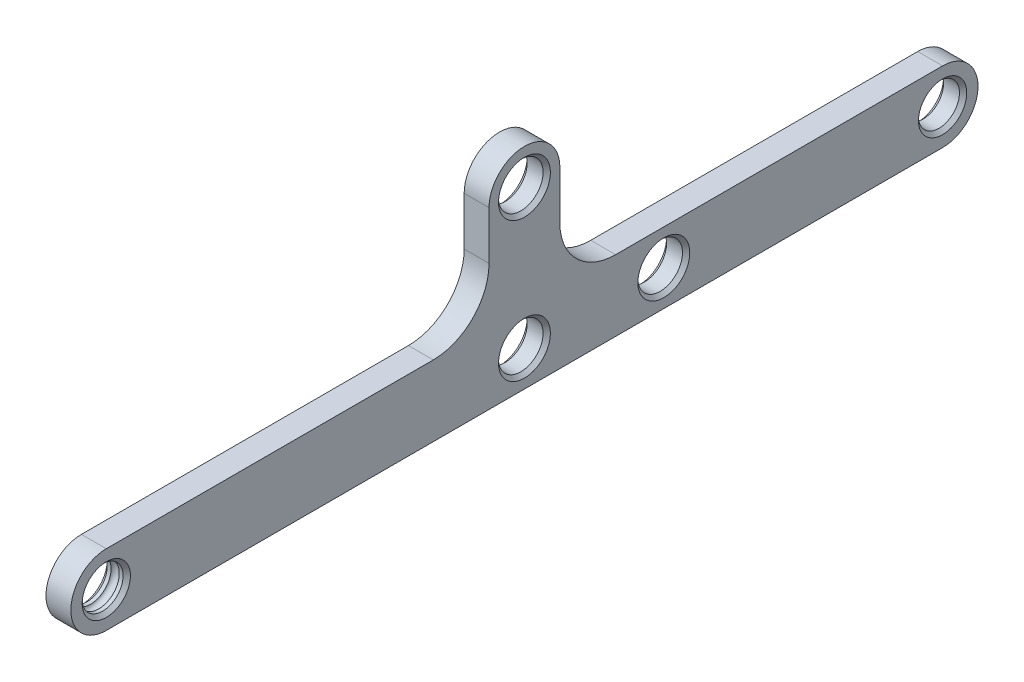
ISO-10303-21;
HEADER;
FILE_DESCRIPTION(('STEP AP214'),'2;1');
FILE_NAME('part.step','',(''),(''),'','','');
FILE_SCHEMA(('AUTOMOTIVE_DESIGN { 1 0 10303 214 1 1 1 1 }'));
ENDSEC;
DATA;
#1=APPLICATION_CONTEXT('core data for automotive mechanical design processes');
#2=APPLICATION_PROTOCOL_DEFINITION('international standard','automotive_design',2000,#1);
#3=PRODUCT_CONTEXT('',#1,'mechanical');
#4=PRODUCT('Part','Part','',(#3));
#5=PRODUCT_RELATED_PRODUCT_CATEGORY('part','',(#4));
#6=PRODUCT_DEFINITION_FORMATION('','',#4);
#7=PRODUCT_DEFINITION_CONTEXT('part definition',#1,'design');
#8=PRODUCT_DEFINITION('design','',#6,#7);
#9=PRODUCT_DEFINITION_SHAPE('','',#8);
#10=(LENGTH_UNIT() NAMED_UNIT(*) SI_UNIT(.MILLI.,.METRE.));
#11=(NAMED_UNIT(*) PLANE_ANGLE_UNIT() SI_UNIT($,.RADIAN.));
#12=(NAMED_UNIT(*) SI_UNIT($,.STERADIAN.) SOLID_ANGLE_UNIT());
#13=UNCERTAINTY_MEASURE_WITH_UNIT(LENGTH_MEASURE(1.E-05),#10,'distance_accuracy_value','');
#14=(GEOMETRIC_REPRESENTATION_CONTEXT(3) GLOBAL_UNCERTAINTY_ASSIGNED_CONTEXT((#13)) GLOBAL_UNIT_ASSIGNED_CONTEXT((#10,
#11,#12)) REPRESENTATION_CONTEXT('',''));
#15=CARTESIAN_POINT('',(0.,0.,0.));
#16=DIRECTION('',(0.,0.,1.));
#17=DIRECTION('',(1.,0.,0.));
#18=AXIS2_PLACEMENT_3D('',#15,#16,#17);
#19=CARTESIAN_POINT('',(4.7625,-6.35,0.));
#20=DIRECTION('',(0.,1.,0.));
#21=DIRECTION('',(0.,0.,1.));
#22=AXIS2_PLACEMENT_3D('',#19,#20,#21);
#23=PLANE('',#22);
#24=DIRECTION('',(0.,0.,-1.));
#25=VECTOR('',#24,1.);
#26=CARTESIAN_POINT('',(4.4625,-6.35,0.));
#27=LINE('',#26,#25);
#28=CARTESIAN_POINT('',(4.4625,-6.35,0.));
#29=VERTEX_POINT('',#28);
#30=CARTESIAN_POINT('',(4.4625,-6.35,-150.));
#31=VERTEX_POINT('',#30);
#32=EDGE_CURVE('E123',#29,#31,#27,.T.);
#33=ORIENTED_EDGE('',*,*,#32,.F.);
#34=DIRECTION('',(-1.,0.,0.));
#35=VECTOR('',#34,1.);
#36=CARTESIAN_POINT('',(4.7625,-6.35,0.));
#37=LINE('',#36,#35);
#38=CARTESIAN_POINT('',(0.,-6.35,0.));
#39=VERTEX_POINT('',#38);
#40=EDGE_CURVE('E134',#29,#39,#37,.T.);
#41=ORIENTED_EDGE('',*,*,#40,.T.);
#42=DIRECTION('',(0.,0.,-1.));
#43=VECTOR('',#42,1.);
#44=CARTESIAN_POINT('',(0.,-6.35,0.));
#45=LINE('',#44,#43);
#46=CARTESIAN_POINT('',(0.,-6.35,-150.));
#47=VERTEX_POINT('',#46);
#48=EDGE_CURVE('E213',#39,#47,#45,.T.);
#49=ORIENTED_EDGE('',*,*,#48,.T.);
#50=DIRECTION('',(-1.,0.,0.));
#51=VECTOR('',#50,1.);
#52=CARTESIAN_POINT('',(4.7625,-6.35,-150.));
#53=LINE('',#52,#51);
#54=EDGE_CURVE('E136',#31,#47,#53,.T.);
#55=ORIENTED_EDGE('',*,*,#54,.F.);
#56=EDGE_LOOP('',(#33,#41,#49,#55));
#57=FACE_BOUND('',#56,.T.);
#58=ADVANCED_FACE('F45',(#57),#23,.F.);
#59=CARTESIAN_POINT('',(4.7625,0.,-150.));
#60=DIRECTION('',(-1.,0.,0.));
#61=DIRECTION('',(0.,0.,1.));
#62=AXIS2_PLACEMENT_3D('',#59,#60,#61);
#63=CYLINDRICAL_SURFACE('',#62,6.35);
#64=CARTESIAN_POINT('',(4.4625,0.,-150.));
#65=DIRECTION('',(1.,0.,0.));
#66=DIRECTION('',(0.,0.,-1.));
#67=AXIS2_PLACEMENT_3D('',#64,#65,#66);
#68=CIRCLE('',#67,6.35);
#69=CARTESIAN_POINT('',(4.4625,6.35,-150.));
#70=VERTEX_POINT('',#69);
#71=EDGE_CURVE('E137',#31,#70,#68,.T.);
#72=ORIENTED_EDGE('',*,*,#71,.F.);
#73=ORIENTED_EDGE('',*,*,#54,.T.);
#74=CARTESIAN_POINT('',(0.,0.,-150.));
#75=DIRECTION('',(1.,0.,0.));
#76=DIRECTION('',(0.,0.,-1.));
#77=AXIS2_PLACEMENT_3D('',#74,#75,#76);
#78=CIRCLE('',#77,6.35);
#79=CARTESIAN_POINT('',(0.,6.35,-150.));
#80=VERTEX_POINT('',#79);
#81=EDGE_CURVE('E258',#47,#80,#78,.T.);
#82=ORIENTED_EDGE('',*,*,#81,.T.);
#83=DIRECTION('',(-1.,0.,0.));
#84=VECTOR('',#83,1.);
#85=CARTESIAN_POINT('',(4.7625,6.35,-150.));
#86=LINE('',#85,#84);
#87=EDGE_CURVE('E156',#70,#80,#86,.T.);
#88=ORIENTED_EDGE('',*,*,#87,.F.);
#89=EDGE_LOOP('',(#72,#73,#82,#88));
#90=FACE_BOUND('',#89,.T.);
#91=ADVANCED_FACE('F283',(#90),#63,.T.);
#92=CARTESIAN_POINT('',(4.7625,6.35,0.));
#93=DIRECTION('',(0.,1.,0.));
#94=DIRECTION('',(0.,0.,1.));
#95=AXIS2_PLACEMENT_3D('',#92,#93,#94);
#96=PLANE('',#95);
#97=DIRECTION('',(0.,0.,-1.));
#98=VECTOR('',#97,1.);
#99=CARTESIAN_POINT('',(0.,6.35,0.));
#100=LINE('',#99,#98);
#101=CARTESIAN_POINT('',(0.,6.35,-91.35));
#102=VERTEX_POINT('',#101);
#103=EDGE_CURVE('E256',#102,#80,#100,.T.);
#104=ORIENTED_EDGE('',*,*,#103,.F.);
#105=DIRECTION('',(-1.,0.,0.));
#106=VECTOR('',#105,1.);
#107=CARTESIAN_POINT('',(4.7625,6.35,-91.35));
#108=LINE('',#107,#106);
#109=CARTESIAN_POINT('',(4.4625,6.35,-91.35));
#110=VERTEX_POINT('',#109);
#111=EDGE_CURVE('E66',#102,#110,#108,.F.);
#112=ORIENTED_EDGE('',*,*,#111,.T.);
#113=DIRECTION('',(0.,0.,1.));
#114=VECTOR('',#113,1.);
#115=CARTESIAN_POINT('',(4.4625,6.35,-150.));
#116=LINE('',#115,#114);
#117=EDGE_CURVE('E277',#70,#110,#116,.T.);
#118=ORIENTED_EDGE('',*,*,#117,.F.);
#119=ORIENTED_EDGE('',*,*,#87,.T.);
#120=EDGE_LOOP('',(#104,#112,#118,#119));
#121=FACE_BOUND('',#120,.T.);
#122=ADVANCED_FACE('F282',(#121),#96,.T.);
#123=CARTESIAN_POINT('',(4.7625,0.,-81.35));
#124=DIRECTION('',(0.,0.,1.));
#125=DIRECTION('',(1.,0.,0.));
#126=AXIS2_PLACEMENT_3D('',#123,#124,#125);
#127=PLANE('',#126);
#128=DIRECTION('',(0.,1.,0.));
#129=VECTOR('',#128,1.);
#130=CARTESIAN_POINT('',(4.4625,6.35,-81.35));
#131=LINE('',#130,#129);
#132=CARTESIAN_POINT('',(4.4625,16.35,-81.35));
#133=VERTEX_POINT('',#132);
#134=CARTESIAN_POINT('',(4.4625,25.,-81.35));
#135=VERTEX_POINT('',#134);
#136=EDGE_CURVE('E275',#133,#135,#131,.T.);
#137=ORIENTED_EDGE('',*,*,#136,.F.);
#138=DIRECTION('',(-1.,0.,0.));
#139=VECTOR('',#138,1.);
#140=CARTESIAN_POINT('',(4.7625,16.35,-81.35));
#141=LINE('',#140,#139);
#142=CARTESIAN_POINT('',(0.,16.35,-81.35));
#143=VERTEX_POINT('',#142);
#144=EDGE_CURVE('E222',#133,#143,#141,.T.);
#145=ORIENTED_EDGE('',*,*,#144,.T.);
#146=DIRECTION('',(0.,1.,0.));
#147=VECTOR('',#146,1.);
#148=CARTESIAN_POINT('',(0.,0.,-81.35));
#149=LINE('',#148,#147);
#150=CARTESIAN_POINT('',(0.,25.,-81.35));
#151=VERTEX_POINT('',#150);
#152=EDGE_CURVE('E252',#143,#151,#149,.T.);
#153=ORIENTED_EDGE('',*,*,#152,.T.);
#154=DIRECTION('',(-1.,0.,0.));
#155=VECTOR('',#154,1.);
#156=CARTESIAN_POINT('',(4.7625,25.,-81.35));
#157=LINE('',#156,#155);
#158=EDGE_CURVE('E153',#135,#151,#157,.T.);
#159=ORIENTED_EDGE('',*,*,#158,.F.);
#160=EDGE_LOOP('',(#137,#145,#153,#159));
#161=FACE_BOUND('',#160,.T.);
#162=ADVANCED_FACE('F291',(#161),#127,.F.);
#163=CARTESIAN_POINT('',(4.7625,25.,-75.));
#164=DIRECTION('',(-1.,0.,0.));
#165=DIRECTION('',(0.,0.,1.));
#166=AXIS2_PLACEMENT_3D('',#163,#164,#165);
#167=CYLINDRICAL_SURFACE('',#166,6.35000000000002);
#168=CARTESIAN_POINT('',(4.4625,25.,-75.));
#169=DIRECTION('',(1.,0.,0.));
#170=DIRECTION('',(0.,0.,-1.));
#171=AXIS2_PLACEMENT_3D('',#168,#169,#170);
#172=CIRCLE('',#171,6.35000000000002);
#173=CARTESIAN_POINT('',(4.4625,25.,-68.65));
#174=VERTEX_POINT('',#173);
#175=EDGE_CURVE('E273',#135,#174,#172,.T.);
#176=ORIENTED_EDGE('',*,*,#175,.F.);
#177=ORIENTED_EDGE('',*,*,#158,.T.);
#178=CARTESIAN_POINT('',(0.,25.,-75.));
#179=DIRECTION('',(1.,0.,0.));
#180=DIRECTION('',(0.,0.,-1.));
#181=AXIS2_PLACEMENT_3D('',#178,#179,#180);
#182=CIRCLE('',#181,6.35000000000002);
#183=CARTESIAN_POINT('',(0.,25.,-68.65));
#184=VERTEX_POINT('',#183);
#185=EDGE_CURVE('E250',#151,#184,#182,.T.);
#186=ORIENTED_EDGE('',*,*,#185,.T.);
#187=DIRECTION('',(-1.,0.,0.));
#188=VECTOR('',#187,1.);
#189=CARTESIAN_POINT('',(4.7625,25.,-68.65));
#190=LINE('',#189,#188);
#191=EDGE_CURVE('E145',#174,#184,#190,.T.);
#192=ORIENTED_EDGE('',*,*,#191,.F.);
#193=EDGE_LOOP('',(#176,#177,#186,#192));
#194=FACE_BOUND('',#193,.T.);
#195=ADVANCED_FACE('F293',(#194),#167,.T.);
#196=CARTESIAN_POINT('',(4.7625,0.,-68.65));
#197=DIRECTION('',(0.,0.,1.));
#198=DIRECTION('',(1.,0.,0.));
#199=AXIS2_PLACEMENT_3D('',#196,#197,#198);
#200=PLANE('',#199);
#201=DIRECTION('',(0.,1.,0.));
#202=VECTOR('',#201,1.);
#203=CARTESIAN_POINT('',(0.,0.,-68.65));
#204=LINE('',#203,#202);
#205=CARTESIAN_POINT('',(0.,16.35,-68.65));
#206=VERTEX_POINT('',#205);
#207=EDGE_CURVE('E245',#206,#184,#204,.T.);
#208=ORIENTED_EDGE('',*,*,#207,.F.);
#209=DIRECTION('',(-1.,0.,0.));
#210=VECTOR('',#209,1.);
#211=CARTESIAN_POINT('',(4.4625,16.35,-68.65));
#212=LINE('',#211,#210);
#213=CARTESIAN_POINT('',(4.4625,16.35,-68.65));
#214=VERTEX_POINT('',#213);
#215=EDGE_CURVE('E220',#206,#214,#212,.F.);
#216=ORIENTED_EDGE('',*,*,#215,.T.);
#217=DIRECTION('',(0.,-1.,0.));
#218=VECTOR('',#217,1.);
#219=CARTESIAN_POINT('',(4.4625,25.,-68.65));
#220=LINE('',#219,#218);
#221=EDGE_CURVE('E232',#174,#214,#220,.T.);
#222=ORIENTED_EDGE('',*,*,#221,.F.);
#223=ORIENTED_EDGE('',*,*,#191,.T.);
#224=EDGE_LOOP('',(#208,#216,#222,#223));
#225=FACE_BOUND('',#224,.T.);
#226=ADVANCED_FACE('F247',(#225),#200,.T.);
#227=CARTESIAN_POINT('',(4.7625,6.35,0.));
#228=DIRECTION('',(0.,1.,0.));
#229=DIRECTION('',(0.,0.,1.));
#230=AXIS2_PLACEMENT_3D('',#227,#228,#229);
#231=PLANE('',#230);
#232=DIRECTION('',(0.,0.,1.));
#233=VECTOR('',#232,1.);
#234=CARTESIAN_POINT('',(4.4625,6.35,-68.65));
#235=LINE('',#234,#233);
#236=CARTESIAN_POINT('',(4.4625,6.35,-58.65));
#237=VERTEX_POINT('',#236);
#238=CARTESIAN_POINT('',(4.4625,6.35,0.));
#239=VERTEX_POINT('',#238);
#240=EDGE_CURVE('E126',#237,#239,#235,.T.);
#241=ORIENTED_EDGE('',*,*,#240,.F.);
#242=DIRECTION('',(-1.,0.,0.));
#243=VECTOR('',#242,1.);
#244=CARTESIAN_POINT('',(0.,6.35,-58.65));
#245=LINE('',#244,#243);
#246=CARTESIAN_POINT('',(0.,6.35,-58.65));
#247=VERTEX_POINT('',#246);
#248=EDGE_CURVE('E205',#237,#247,#245,.T.);
#249=ORIENTED_EDGE('',*,*,#248,.T.);
#250=DIRECTION('',(0.,0.,-1.));
#251=VECTOR('',#250,1.);
#252=CARTESIAN_POINT('',(0.,6.35,0.));
#253=LINE('',#252,#251);
#254=CARTESIAN_POINT('',(0.,6.35,0.));
#255=VERTEX_POINT('',#254);
#256=EDGE_CURVE('E147',#255,#247,#253,.T.);
#257=ORIENTED_EDGE('',*,*,#256,.F.);
#258=DIRECTION('',(-1.,0.,0.));
#259=VECTOR('',#258,1.);
#260=CARTESIAN_POINT('',(4.7625,6.35,0.));
#261=LINE('',#260,#259);
#262=EDGE_CURVE('E143',#239,#255,#261,.T.);
#263=ORIENTED_EDGE('',*,*,#262,.F.);
#264=EDGE_LOOP('',(#241,#249,#257,#263));
#265=FACE_BOUND('',#264,.T.);
#266=ADVANCED_FACE('F237',(#265),#231,.T.);
#267=CARTESIAN_POINT('',(4.7625,0.,0.));
#268=DIRECTION('',(-1.,0.,0.));
#269=DIRECTION('',(0.,0.,1.));
#270=AXIS2_PLACEMENT_3D('',#267,#268,#269);
#271=CYLINDRICAL_SURFACE('',#270,6.35);
#272=CARTESIAN_POINT('',(4.4625,0.,0.));
#273=DIRECTION('',(1.,0.,0.));
#274=DIRECTION('',(0.,0.,-1.));
#275=AXIS2_PLACEMENT_3D('',#272,#273,#274);
#276=CIRCLE('',#275,6.35);
#277=EDGE_CURVE('E120',#239,#29,#276,.T.);
#278=ORIENTED_EDGE('',*,*,#277,.F.);
#279=ORIENTED_EDGE('',*,*,#262,.T.);
#280=CARTESIAN_POINT('',(0.,0.,0.));
#281=DIRECTION('',(1.,0.,0.));
#282=DIRECTION('',(0.,0.,-1.));
#283=AXIS2_PLACEMENT_3D('',#280,#281,#282);
#284=CIRCLE('',#283,6.35);
#285=EDGE_CURVE('E141',#255,#39,#284,.T.);
#286=ORIENTED_EDGE('',*,*,#285,.T.);
#287=ORIENTED_EDGE('',*,*,#40,.F.);
#288=EDGE_LOOP('',(#278,#279,#286,#287));
#289=FACE_BOUND('',#288,.T.);
#290=ADVANCED_FACE('F139',(#289),#271,.T.);
#291=CARTESIAN_POINT('',(3.80999999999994,0.,0.));
#292=DIRECTION('',(1.,0.,0.));
#293=DIRECTION('',(0.,0.,-1.));
#294=AXIS2_PLACEMENT_3D('',#291,#292,#293);
#295=CONICAL_SURFACE('',#294,3.675,0.785398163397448);
#296=CARTESIAN_POINT('',(3.80999999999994,0.,0.));
#297=DIRECTION('',(1.,0.,0.));
#298=DIRECTION('',(0.,0.,-1.));
#299=AXIS2_PLACEMENT_3D('',#296,#297,#298);
#300=CIRCLE('',#299,3.675);
#301=CARTESIAN_POINT('',(3.80999999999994,0.,-3.675));
#302=VERTEX_POINT('',#301);
#303=EDGE_CURVE('E175',#302,#302,#300,.T.);
#304=CARTESIAN_POINT('',(4.4625,0.,0.));
#305=DIRECTION('',(1.,0.,0.));
#306=DIRECTION('',(0.,0.,-1.));
#307=AXIS2_PLACEMENT_3D('',#304,#305,#306);
#308=CIRCLE('',#307,4.32750000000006);
#309=CARTESIAN_POINT('',(4.4625,0.,-4.32750000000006));
#310=VERTEX_POINT('',#309);
#311=EDGE_CURVE('E210',#310,#310,#308,.T.);
#312=CARTESIAN_POINT('',(3.80999999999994,0.,-3.675));
#313=CARTESIAN_POINT('',(3.81679687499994,0.,-3.681796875));
#314=CARTESIAN_POINT('',(3.82359374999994,0.,-3.68859375));
#315=CARTESIAN_POINT('',(3.83718749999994,0.,-3.7021875));
#316=CARTESIAN_POINT('',(3.84398437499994,0.,-3.708984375));
#317=CARTESIAN_POINT('',(3.85757812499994,0.,-3.722578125));
#318=CARTESIAN_POINT('',(3.86437499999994,0.,-3.729375));
#319=CARTESIAN_POINT('',(3.87796874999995,0.,-3.74296875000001));
#320=CARTESIAN_POINT('',(3.88476562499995,0.,-3.74976562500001));
#321=CARTESIAN_POINT('',(3.89835937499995,0.,-3.76335937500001));
#322=CARTESIAN_POINT('',(3.90515624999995,0.,-3.77015625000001));
#323=CARTESIAN_POINT('',(3.91874999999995,0.,-3.78375000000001));
#324=CARTESIAN_POINT('',(3.92554687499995,0.,-3.79054687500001));
#325=CARTESIAN_POINT('',(3.93914062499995,0.,-3.80414062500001));
#326=CARTESIAN_POINT('',(3.94593749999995,0.,-3.81093750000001));
#327=CARTESIAN_POINT('',(3.95953124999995,0.,-3.82453125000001));
#328=CARTESIAN_POINT('',(3.96632812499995,0.,-3.83132812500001));
#329=CARTESIAN_POINT('',(3.97992187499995,0.,-3.84492187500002));
#330=CARTESIAN_POINT('',(3.98671874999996,0.,-3.85171875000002));
#331=CARTESIAN_POINT('',(4.00031249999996,0.,-3.86531250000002));
#332=CARTESIAN_POINT('',(4.00710937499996,0.,-3.87210937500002));
#333=CARTESIAN_POINT('',(4.02070312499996,0.,-3.88570312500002));
#334=CARTESIAN_POINT('',(4.02749999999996,0.,-3.89250000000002));
#335=CARTESIAN_POINT('',(4.04109374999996,0.,-3.90609375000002));
#336=CARTESIAN_POINT('',(4.04789062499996,0.,-3.91289062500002));
#337=CARTESIAN_POINT('',(4.06148437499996,0.,-3.92648437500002));
#338=CARTESIAN_POINT('',(4.06828124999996,0.,-3.93328125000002));
#339=CARTESIAN_POINT('',(4.08187499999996,0.,-3.94687500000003));
#340=CARTESIAN_POINT('',(4.08867187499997,0.,-3.95367187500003));
#341=CARTESIAN_POINT('',(4.10226562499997,0.,-3.96726562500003));
#342=CARTESIAN_POINT('',(4.10906249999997,0.,-3.97406250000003));
#343=CARTESIAN_POINT('',(4.12265624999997,0.,-3.98765625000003));
#344=CARTESIAN_POINT('',(4.12945312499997,0.,-3.99445312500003));
#345=CARTESIAN_POINT('',(4.14304687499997,0.,-4.00804687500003));
#346=CARTESIAN_POINT('',(4.14984374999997,0.,-4.01484375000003));
#347=CARTESIAN_POINT('',(4.16343749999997,0.,-4.02843750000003));
#348=CARTESIAN_POINT('',(4.17023437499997,0.,-4.03523437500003));
#349=CARTESIAN_POINT('',(4.18382812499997,0.,-4.04882812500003));
#350=CARTESIAN_POINT('',(4.19062499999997,0.,-4.05562500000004));
#351=CARTESIAN_POINT('',(4.20421874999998,0.,-4.06921875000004));
#352=CARTESIAN_POINT('',(4.21101562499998,0.,-4.07601562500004));
#353=CARTESIAN_POINT('',(4.22460937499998,0.,-4.08960937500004));
#354=CARTESIAN_POINT('',(4.23140624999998,0.,-4.09640625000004));
#355=CARTESIAN_POINT('',(4.24499999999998,0.,-4.11000000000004));
#356=CARTESIAN_POINT('',(4.25179687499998,0.,-4.11679687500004));
#357=CARTESIAN_POINT('',(4.26539062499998,0.,-4.13039062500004));
#358=CARTESIAN_POINT('',(4.27218749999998,0.,-4.13718750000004));
#359=CARTESIAN_POINT('',(4.28578124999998,0.,-4.15078125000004));
#360=CARTESIAN_POINT('',(4.29257812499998,0.,-4.15757812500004));
#361=CARTESIAN_POINT('',(4.30617187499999,0.,-4.17117187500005));
#362=CARTESIAN_POINT('',(4.31296874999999,0.,-4.17796875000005));
#363=CARTESIAN_POINT('',(4.32656249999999,0.,-4.19156250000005));
#364=CARTESIAN_POINT('',(4.33335937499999,0.,-4.19835937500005));
#365=CARTESIAN_POINT('',(4.34695312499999,0.,-4.21195312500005));
#366=CARTESIAN_POINT('',(4.35374999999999,0.,-4.21875000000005));
#367=CARTESIAN_POINT('',(4.36734374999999,0.,-4.23234375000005));
#368=CARTESIAN_POINT('',(4.37414062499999,0.,-4.23914062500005));
#369=CARTESIAN_POINT('',(4.38773437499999,0.,-4.25273437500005));
#370=CARTESIAN_POINT('',(4.39453124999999,0.,-4.25953125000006));
#371=CARTESIAN_POINT('',(4.40812499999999,0.,-4.27312500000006));
#372=CARTESIAN_POINT('',(4.414921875,0.,-4.27992187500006));
#373=CARTESIAN_POINT('',(4.428515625,0.,-4.29351562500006));
#374=CARTESIAN_POINT('',(4.4353125,0.,-4.30031250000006));
#375=CARTESIAN_POINT('',(4.44890625,0.,-4.31390625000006));
#376=CARTESIAN_POINT('',(4.455703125,0.,-4.32070312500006));
#377=CARTESIAN_POINT('',(4.4625,0.,-4.32750000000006));
#378=B_SPLINE_CURVE_WITH_KNOTS('',3,(#312,#313,#314,#315,#316,#317,#318,#319,#320,#321,#322,
#323,#324,#325,#326,#327,#328,#329,#330,#331,#332,#333,#334,#335,#336,#337,#338,#339,#340,#341,
#342,#343,#344,#345,#346,#347,#348,#349,#350,#351,#352,#353,#354,#355,#356,#357,#358,#359,#360,
#361,#362,#363,#364,#365,#366,#367,#368,#369,#370,#371,#372,#373,#374,#375,#376,#377),
.UNSPECIFIED.,.F.,.F.,(4,2,2,2,2,2,2,2,2,2,2,2,2,2,2,2,2,2,2,2,2,2,2,2,2,2,2,2,2,2,2,2,4),(0.,
0.0288366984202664,0.0576733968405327,0.0865100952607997,0.115346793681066,0.144183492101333,
0.173020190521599,0.201856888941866,0.230693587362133,0.259530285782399,0.288366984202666,
0.317203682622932,0.346040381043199,0.374877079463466,0.403713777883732,0.432550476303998,
0.461387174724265,0.490223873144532,0.519060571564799,0.547897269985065,0.576733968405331,
0.605570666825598,0.634407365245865,0.663244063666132,0.692080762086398,0.720917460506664,
0.749754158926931,0.778590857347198,0.807427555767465,0.836264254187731,0.865100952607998,
0.893937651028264,0.922774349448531),.UNSPECIFIED.);
#379=EDGE_CURVE('BSEAM321',#302,#310,#378,.T.);
#380=ORIENTED_EDGE('',*,*,#303,.F.);
#381=ORIENTED_EDGE('',*,*,#311,.T.);
#382=ORIENTED_EDGE('',*,*,#379,.T.);
#383=ORIENTED_EDGE('',*,*,#379,.F.);
#384=EDGE_LOOP('',(#380,#382,#381,#383));
#385=FACE_BOUND('',#384,.T.);
#386=ADVANCED_FACE('F321',(#385),#295,.F.);
#387=CARTESIAN_POINT('',(3.80999999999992,0.,-150.));
#388=DIRECTION('',(1.,0.,0.));
#389=DIRECTION('',(0.,0.,-1.));
#390=AXIS2_PLACEMENT_3D('',#387,#388,#389);
#391=CONICAL_SURFACE('',#390,3.67500000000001,0.785398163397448);
#392=CARTESIAN_POINT('',(3.80999999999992,0.,-150.));
#393=DIRECTION('',(1.,0.,0.));
#394=DIRECTION('',(0.,0.,-1.));
#395=AXIS2_PLACEMENT_3D('',#392,#393,#394);
#396=CIRCLE('',#395,3.67500000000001);
#397=CARTESIAN_POINT('',(3.80999999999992,0.,-153.675));
#398=VERTEX_POINT('',#397);
#399=EDGE_CURVE('E181',#398,#398,#396,.T.);
#400=CARTESIAN_POINT('',(4.4625,0.,-150.));
#401=DIRECTION('',(1.,0.,0.));
#402=DIRECTION('',(0.,0.,-1.));
#403=AXIS2_PLACEMENT_3D('',#400,#401,#402);
#404=CIRCLE('',#403,4.32750000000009);
#405=CARTESIAN_POINT('',(4.4625,0.,-154.3275));
#406=VERTEX_POINT('',#405);
#407=EDGE_CURVE('E264',#406,#406,#404,.T.);
#408=CARTESIAN_POINT('',(3.80999999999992,0.,-153.675));
#409=CARTESIAN_POINT('',(3.81679687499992,0.,-153.681796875));
#410=CARTESIAN_POINT('',(3.82359374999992,0.,-153.68859375));
#411=CARTESIAN_POINT('',(3.83718749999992,0.,-153.7021875));
#412=CARTESIAN_POINT('',(3.84398437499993,0.,-153.708984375));
#413=CARTESIAN_POINT('',(3.85757812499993,0.,-153.722578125));
#414=CARTESIAN_POINT('',(3.86437499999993,0.,-153.729375));
#415=CARTESIAN_POINT('',(3.87796874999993,0.,-153.74296875));
#416=CARTESIAN_POINT('',(3.88476562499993,0.,-153.749765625));
#417=CARTESIAN_POINT('',(3.89835937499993,0.,-153.763359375));
#418=CARTESIAN_POINT('',(3.90515624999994,0.,-153.77015625));
#419=CARTESIAN_POINT('',(3.91874999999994,0.,-153.78375));
#420=CARTESIAN_POINT('',(3.92554687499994,0.,-153.790546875));
#421=CARTESIAN_POINT('',(3.93914062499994,0.,-153.804140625));
#422=CARTESIAN_POINT('',(3.94593749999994,0.,-153.8109375));
#423=CARTESIAN_POINT('',(3.95953124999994,0.,-153.82453125));
#424=CARTESIAN_POINT('',(3.96632812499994,0.,-153.831328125));
#425=CARTESIAN_POINT('',(3.97992187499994,0.,-153.844921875));
#426=CARTESIAN_POINT('',(3.98671874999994,0.,-153.85171875));
#427=CARTESIAN_POINT('',(4.00031249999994,0.,-153.8653125));
#428=CARTESIAN_POINT('',(4.00710937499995,0.,-153.872109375));
#429=CARTESIAN_POINT('',(4.02070312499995,0.,-153.885703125));
#430=CARTESIAN_POINT('',(4.02749999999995,0.,-153.8925));
#431=CARTESIAN_POINT('',(4.04109374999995,0.,-153.90609375));
#432=CARTESIAN_POINT('',(4.04789062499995,0.,-153.912890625));
#433=CARTESIAN_POINT('',(4.06148437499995,0.,-153.926484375));
#434=CARTESIAN_POINT('',(4.06828124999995,0.,-153.93328125));
#435=CARTESIAN_POINT('',(4.08187499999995,0.,-153.946875));
#436=CARTESIAN_POINT('',(4.08867187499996,0.,-153.953671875));
#437=CARTESIAN_POINT('',(4.10226562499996,0.,-153.967265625));
#438=CARTESIAN_POINT('',(4.10906249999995,0.,-153.9740625));
#439=CARTESIAN_POINT('',(4.12265624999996,0.,-153.98765625));
#440=CARTESIAN_POINT('',(4.12945312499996,0.,-153.994453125));
#441=CARTESIAN_POINT('',(4.14304687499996,0.,-154.008046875));
#442=CARTESIAN_POINT('',(4.14984374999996,0.,-154.01484375));
#443=CARTESIAN_POINT('',(4.16343749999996,0.,-154.0284375));
#444=CARTESIAN_POINT('',(4.17023437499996,0.,-154.035234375));
#445=CARTESIAN_POINT('',(4.18382812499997,0.,-154.048828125));
#446=CARTESIAN_POINT('',(4.19062499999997,0.,-154.055625));
#447=CARTESIAN_POINT('',(4.20421874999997,0.,-154.06921875));
#448=CARTESIAN_POINT('',(4.21101562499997,0.,-154.076015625));
#449=CARTESIAN_POINT('',(4.22460937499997,0.,-154.089609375));
#450=CARTESIAN_POINT('',(4.23140624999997,0.,-154.09640625));
#451=CARTESIAN_POINT('',(4.24499999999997,0.,-154.11));
#452=CARTESIAN_POINT('',(4.25179687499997,0.,-154.116796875));
#453=CARTESIAN_POINT('',(4.26539062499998,0.,-154.130390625));
#454=CARTESIAN_POINT('',(4.27218749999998,0.,-154.1371875));
#455=CARTESIAN_POINT('',(4.28578124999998,0.,-154.15078125));
#456=CARTESIAN_POINT('',(4.29257812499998,0.,-154.157578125));
#457=CARTESIAN_POINT('',(4.30617187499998,0.,-154.171171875));
#458=CARTESIAN_POINT('',(4.31296874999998,0.,-154.17796875));
#459=CARTESIAN_POINT('',(4.32656249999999,0.,-154.1915625));
#460=CARTESIAN_POINT('',(4.33335937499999,0.,-154.198359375));
#461=CARTESIAN_POINT('',(4.34695312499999,0.,-154.211953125));
#462=CARTESIAN_POINT('',(4.35374999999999,0.,-154.21875));
#463=CARTESIAN_POINT('',(4.36734374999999,0.,-154.23234375));
#464=CARTESIAN_POINT('',(4.37414062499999,0.,-154.239140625));
#465=CARTESIAN_POINT('',(4.38773437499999,0.,-154.252734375));
#466=CARTESIAN_POINT('',(4.39453124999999,0.,-154.25953125));
#467=CARTESIAN_POINT('',(4.40812499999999,0.,-154.273125));
#468=CARTESIAN_POINT('',(4.41492187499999,0.,-154.279921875));
#469=CARTESIAN_POINT('',(4.428515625,0.,-154.293515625));
#470=CARTESIAN_POINT('',(4.4353125,0.,-154.3003125));
#471=CARTESIAN_POINT('',(4.44890625,0.,-154.31390625));
#472=CARTESIAN_POINT('',(4.455703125,0.,-154.320703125));
#473=CARTESIAN_POINT('',(4.4625,0.,-154.3275));
#474=B_SPLINE_CURVE_WITH_KNOTS('',3,(#408,#409,#410,#411,#412,#413,#414,#415,#416,#417,#418,
#419,#420,#421,#422,#423,#424,#425,#426,#427,#428,#429,#430,#431,#432,#433,#434,#435,#436,#437,
#438,#439,#440,#441,#442,#443,#444,#445,#446,#447,#448,#449,#450,#451,#452,#453,#454,#455,#456,
#457,#458,#459,#460,#461,#462,#463,#464,#465,#466,#467,#468,#469,#470,#471,#472,#473),
.UNSPECIFIED.,.F.,.F.,(4,2,2,2,2,2,2,2,2,2,2,2,2,2,2,2,2,2,2,2,2,2,2,2,2,2,2,2,2,2,2,2,4),(0.,
0.0288366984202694,0.0576733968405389,0.086510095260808,0.115346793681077,0.144183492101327,
0.173020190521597,0.201856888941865,0.230693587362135,0.259530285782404,0.288366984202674,
0.317203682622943,0.346040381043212,0.374877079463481,0.403713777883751,0.43255047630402,
0.46138717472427,0.490223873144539,0.519060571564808,0.547897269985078,0.576733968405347,
0.605570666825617,0.634407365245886,0.663244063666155,0.692080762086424,0.720917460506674,
0.749754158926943,0.778590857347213,0.807427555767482,0.836264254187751,0.86510095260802,
0.89393765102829,0.922774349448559),.UNSPECIFIED.);
#475=EDGE_CURVE('BSEAM327',#398,#406,#474,.T.);
#476=ORIENTED_EDGE('',*,*,#399,.F.);
#477=ORIENTED_EDGE('',*,*,#407,.T.);
#478=ORIENTED_EDGE('',*,*,#475,.T.);
#479=ORIENTED_EDGE('',*,*,#475,.F.);
#480=EDGE_LOOP('',(#476,#478,#477,#479));
#481=FACE_BOUND('',#480,.T.);
#482=ADVANCED_FACE('F327',(#481),#391,.F.);
#483=CARTESIAN_POINT('',(3.80999999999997,0.,-75.));
#484=DIRECTION('',(1.,0.,0.));
#485=DIRECTION('',(0.,0.,-1.));
#486=AXIS2_PLACEMENT_3D('',#483,#484,#485);
#487=CONICAL_SURFACE('',#486,4.00000000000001,0.785398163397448);
#488=CARTESIAN_POINT('',(3.80999999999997,0.,-75.));
#489=DIRECTION('',(1.,0.,0.));
#490=DIRECTION('',(0.,0.,-1.));
#491=AXIS2_PLACEMENT_3D('',#488,#489,#490);
#492=CIRCLE('',#491,4.00000000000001);
#493=CARTESIAN_POINT('',(3.80999999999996,0.,-71.));
#494=VERTEX_POINT('',#493);
#495=EDGE_CURVE('E187',#494,#494,#492,.T.);
#496=ORIENTED_EDGE('',*,*,#495,.F.);
#497=EDGE_LOOP('',(#496));
#498=FACE_BOUND('',#497,.T.);
#499=CARTESIAN_POINT('',(4.4625,0.,-75.));
#500=DIRECTION('',(1.,0.,0.));
#501=DIRECTION('',(0.,0.,-1.));
#502=AXIS2_PLACEMENT_3D('',#499,#500,#501);
#503=CIRCLE('',#502,4.65250000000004);
#504=CARTESIAN_POINT('',(4.4625,0.,-79.6525));
#505=VERTEX_POINT('',#504);
#506=EDGE_CURVE('E267',#505,#505,#503,.T.);
#507=ORIENTED_EDGE('',*,*,#506,.T.);
#508=EDGE_LOOP('',(#507));
#509=FACE_BOUND('',#508,.T.);
#510=ADVANCED_FACE('F341',(#498,#509),#487,.F.);
#511=CARTESIAN_POINT('',(3.80999999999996,25.,-75.));
#512=DIRECTION('',(1.,0.,0.));
#513=DIRECTION('',(0.,0.,-1.));
#514=AXIS2_PLACEMENT_3D('',#511,#512,#513);
#515=CONICAL_SURFACE('',#514,4.00000000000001,0.785398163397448);
#516=CARTESIAN_POINT('',(3.80999999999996,25.,-75.));
#517=DIRECTION('',(1.,0.,0.));
#518=DIRECTION('',(0.,0.,-1.));
#519=AXIS2_PLACEMENT_3D('',#516,#517,#518);
#520=CIRCLE('',#519,4.00000000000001);
#521=CARTESIAN_POINT('',(3.80999999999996,25.,-79.));
#522=VERTEX_POINT('',#521);
#523=EDGE_CURVE('E193',#522,#522,#520,.T.);
#524=CARTESIAN_POINT('',(4.4625,25.,-75.));
#525=DIRECTION('',(1.,0.,0.));
#526=DIRECTION('',(0.,0.,-1.));
#527=AXIS2_PLACEMENT_3D('',#524,#525,#526);
#528=CIRCLE('',#527,4.65250000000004);
#529=CARTESIAN_POINT('',(4.4625,25.,-79.6525));
#530=VERTEX_POINT('',#529);
#531=EDGE_CURVE('E217',#530,#530,#528,.T.);
#532=CARTESIAN_POINT('',(3.80999999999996,25.,-79.));
#533=CARTESIAN_POINT('',(3.81679687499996,25.,-79.006796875));
#534=CARTESIAN_POINT('',(3.82359374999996,25.,-79.01359375));
#535=CARTESIAN_POINT('',(3.83718749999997,25.,-79.0271875));
#536=CARTESIAN_POINT('',(3.84398437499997,25.,-79.033984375));
#537=CARTESIAN_POINT('',(3.85757812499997,25.,-79.047578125));
#538=CARTESIAN_POINT('',(3.86437499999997,25.,-79.054375));
#539=CARTESIAN_POINT('',(3.87796874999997,25.,-79.06796875));
#540=CARTESIAN_POINT('',(3.88476562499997,25.,-79.074765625));
#541=CARTESIAN_POINT('',(3.89835937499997,25.,-79.088359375));
#542=CARTESIAN_POINT('',(3.90515624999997,25.,-79.09515625));
#543=CARTESIAN_POINT('',(3.91874999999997,25.,-79.10875));
#544=CARTESIAN_POINT('',(3.92554687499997,25.,-79.115546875));
#545=CARTESIAN_POINT('',(3.93914062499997,25.,-79.129140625));
#546=CARTESIAN_POINT('',(3.94593749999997,25.,-79.1359375));
#547=CARTESIAN_POINT('',(3.95953124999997,25.,-79.14953125));
#548=CARTESIAN_POINT('',(3.96632812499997,25.,-79.156328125));
#549=CARTESIAN_POINT('',(3.97992187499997,25.,-79.169921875));
#550=CARTESIAN_POINT('',(3.98671874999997,25.,-79.17671875));
#551=CARTESIAN_POINT('',(4.00031249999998,25.,-79.1903125));
#552=CARTESIAN_POINT('',(4.00710937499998,25.,-79.197109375));
#553=CARTESIAN_POINT('',(4.02070312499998,25.,-79.210703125));
#554=CARTESIAN_POINT('',(4.02749999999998,25.,-79.2175));
#555=CARTESIAN_POINT('',(4.04109374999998,25.,-79.23109375));
#556=CARTESIAN_POINT('',(4.04789062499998,25.,-79.237890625));
#557=CARTESIAN_POINT('',(4.06148437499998,25.,-79.251484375));
#558=CARTESIAN_POINT('',(4.06828124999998,25.,-79.25828125));
#559=CARTESIAN_POINT('',(4.08187499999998,25.,-79.271875));
#560=CARTESIAN_POINT('',(4.08867187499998,25.,-79.278671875));
#561=CARTESIAN_POINT('',(4.10226562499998,25.,-79.292265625));
#562=CARTESIAN_POINT('',(4.10906249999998,25.,-79.2990625));
#563=CARTESIAN_POINT('',(4.12265624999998,25.,-79.31265625));
#564=CARTESIAN_POINT('',(4.12945312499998,25.,-79.319453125));
#565=CARTESIAN_POINT('',(4.14304687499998,25.,-79.333046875));
#566=CARTESIAN_POINT('',(4.14984374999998,25.,-79.33984375));
#567=CARTESIAN_POINT('',(4.16343749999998,25.,-79.3534375));
#568=CARTESIAN_POINT('',(4.17023437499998,25.,-79.360234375));
#569=CARTESIAN_POINT('',(4.18382812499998,25.,-79.373828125));
#570=CARTESIAN_POINT('',(4.19062499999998,25.,-79.380625));
#571=CARTESIAN_POINT('',(4.20421874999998,25.,-79.39421875));
#572=CARTESIAN_POINT('',(4.21101562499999,25.,-79.401015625));
#573=CARTESIAN_POINT('',(4.22460937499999,25.,-79.414609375));
#574=CARTESIAN_POINT('',(4.23140624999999,25.,-79.42140625));
#575=CARTESIAN_POINT('',(4.24499999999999,25.,-79.435));
#576=CARTESIAN_POINT('',(4.25179687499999,25.,-79.441796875));
#577=CARTESIAN_POINT('',(4.26539062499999,25.,-79.455390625));
#578=CARTESIAN_POINT('',(4.27218749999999,25.,-79.4621875));
#579=CARTESIAN_POINT('',(4.28578124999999,25.,-79.47578125));
#580=CARTESIAN_POINT('',(4.29257812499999,25.,-79.482578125));
#581=CARTESIAN_POINT('',(4.30617187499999,25.,-79.496171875));
#582=CARTESIAN_POINT('',(4.31296874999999,25.,-79.50296875));
#583=CARTESIAN_POINT('',(4.32656249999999,25.,-79.5165625));
#584=CARTESIAN_POINT('',(4.33335937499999,25.,-79.523359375));
#585=CARTESIAN_POINT('',(4.346953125,25.,-79.536953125));
#586=CARTESIAN_POINT('',(4.35374999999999,25.,-79.54375));
#587=CARTESIAN_POINT('',(4.36734374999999,25.,-79.55734375));
#588=CARTESIAN_POINT('',(4.37414062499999,25.,-79.564140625));
#589=CARTESIAN_POINT('',(4.387734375,25.,-79.577734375));
#590=CARTESIAN_POINT('',(4.39453125,25.,-79.58453125));
#591=CARTESIAN_POINT('',(4.408125,25.,-79.598125));
#592=CARTESIAN_POINT('',(4.414921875,25.,-79.604921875));
#593=CARTESIAN_POINT('',(4.428515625,25.,-79.618515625));
#594=CARTESIAN_POINT('',(4.4353125,25.,-79.6253125));
#595=CARTESIAN_POINT('',(4.44890625,25.,-79.63890625));
#596=CARTESIAN_POINT('',(4.455703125,25.,-79.645703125));
#597=CARTESIAN_POINT('',(4.4625,25.,-79.6525));
#598=B_SPLINE_CURVE_WITH_KNOTS('',3,(#532,#533,#534,#535,#536,#537,#538,#539,#540,#541,#542,
#543,#544,#545,#546,#547,#548,#549,#550,#551,#552,#553,#554,#555,#556,#557,#558,#559,#560,#561,
#562,#563,#564,#565,#566,#567,#568,#569,#570,#571,#572,#573,#574,#575,#576,#577,#578,#579,#580,
#581,#582,#583,#584,#585,#586,#587,#588,#589,#590,#591,#592,#593,#594,#595,#596,#597),
.UNSPECIFIED.,.F.,.F.,(4,2,2,2,2,2,2,2,2,2,2,2,2,2,2,2,2,2,2,2,2,2,2,2,2,2,2,2,2,2,2,2,4),(0.,
0.0288366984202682,0.0576733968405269,0.0865100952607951,0.115346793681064,0.144183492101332,
0.17302019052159,0.201856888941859,0.230693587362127,0.259530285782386,0.288366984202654,
0.317203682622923,0.346040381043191,0.374877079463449,0.403713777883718,0.432550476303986,
0.461387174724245,0.490223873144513,0.519060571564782,0.54789726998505,0.576733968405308,
0.605570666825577,0.634407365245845,0.663244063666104,0.692080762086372,0.720917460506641,
0.749754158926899,0.778590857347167,0.807427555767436,0.836264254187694,0.865100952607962,
0.893937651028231,0.9227743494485),.UNSPECIFIED.);
#599=EDGE_CURVE('BSEAM355',#522,#530,#598,.T.);
#600=ORIENTED_EDGE('',*,*,#523,.F.);
#601=ORIENTED_EDGE('',*,*,#531,.T.);
#602=ORIENTED_EDGE('',*,*,#599,.T.);
#603=ORIENTED_EDGE('',*,*,#599,.F.);
#604=EDGE_LOOP('',(#600,#602,#601,#603));
#605=FACE_BOUND('',#604,.T.);
#606=ADVANCED_FACE('F355',(#605),#515,.F.);
#607=CARTESIAN_POINT('',(3.80999999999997,0.,-100.));
#608=DIRECTION('',(1.,0.,0.));
#609=DIRECTION('',(0.,0.,-1.));
#610=AXIS2_PLACEMENT_3D('',#607,#608,#609);
#611=CONICAL_SURFACE('',#610,4.00000000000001,0.785398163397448);
#612=CARTESIAN_POINT('',(3.80999999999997,0.,-100.));
#613=DIRECTION('',(1.,0.,0.));
#614=DIRECTION('',(0.,0.,-1.));
#615=AXIS2_PLACEMENT_3D('',#612,#613,#614);
#616=CIRCLE('',#615,4.00000000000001);
#617=CARTESIAN_POINT('',(3.80999999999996,0.,-96.));
#618=VERTEX_POINT('',#617);
#619=EDGE_CURVE('E199',#618,#618,#616,.T.);
#620=ORIENTED_EDGE('',*,*,#619,.F.);
#621=EDGE_LOOP('',(#620));
#622=FACE_BOUND('',#621,.T.);
#623=CARTESIAN_POINT('',(4.4625,0.,-100.));
#624=DIRECTION('',(1.,0.,0.));
#625=DIRECTION('',(0.,0.,-1.));
#626=AXIS2_PLACEMENT_3D('',#623,#624,#625);
#627=CIRCLE('',#626,4.65250000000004);
#628=CARTESIAN_POINT('',(4.4625,0.,-104.6525));
#629=VERTEX_POINT('',#628);
#630=EDGE_CURVE('E214',#629,#629,#627,.T.);
#631=ORIENTED_EDGE('',*,*,#630,.T.);
#632=EDGE_LOOP('',(#631));
#633=FACE_BOUND('',#632,.T.);
#634=ADVANCED_FACE('F369',(#622,#633),#611,.F.);
#635=CARTESIAN_POINT('',(4.7625,0.,0.));
#636=DIRECTION('',(-1.,0.,0.));
#637=DIRECTION('',(0.,0.,1.));
#638=AXIS2_PLACEMENT_3D('',#635,#636,#637);
#639=CYLINDRICAL_SURFACE('',#638,3.675);
#640=CARTESIAN_POINT('',(1.64637649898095,0.,0.));
#641=DIRECTION('',(1.,0.,0.));
#642=DIRECTION('',(0.,0.,-1.));
#643=AXIS2_PLACEMENT_3D('',#640,#641,#642);
#644=CIRCLE('',#643,3.675);
#645=CARTESIAN_POINT('',(1.64637649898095,0.,3.675));
#646=VERTEX_POINT('',#645);
#647=EDGE_CURVE('E209',#646,#646,#644,.F.);
#648=CARTESIAN_POINT('',(0.952499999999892,0.,0.));
#649=DIRECTION('',(1.,0.,0.));
#650=DIRECTION('',(0.,0.,-1.));
#651=AXIS2_PLACEMENT_3D('',#648,#649,#650);
#652=CIRCLE('',#651,3.675);
#653=CARTESIAN_POINT('',(0.952499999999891,0.,3.675));
#654=VERTEX_POINT('',#653);
#655=EDGE_CURVE('E178',#654,#654,#652,.F.);
#656=CARTESIAN_POINT('',(1.64637649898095,0.,3.675));
#657=CARTESIAN_POINT('',(1.63914861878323,0.,3.675));
#658=CARTESIAN_POINT('',(1.63192073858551,0.,3.675));
#659=CARTESIAN_POINT('',(1.61746497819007,0.,3.675));
#660=CARTESIAN_POINT('',(1.61023709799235,0.,3.675));
#661=CARTESIAN_POINT('',(1.59578133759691,0.,3.675));
#662=CARTESIAN_POINT('',(1.58855345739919,0.,3.675));
#663=CARTESIAN_POINT('',(1.57409769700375,0.,3.675));
#664=CARTESIAN_POINT('',(1.56686981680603,0.,3.675));
#665=CARTESIAN_POINT('',(1.5524140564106,0.,3.675));
#666=CARTESIAN_POINT('',(1.54518617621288,0.,3.675));
#667=CARTESIAN_POINT('',(1.53073041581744,0.,3.675));
#668=CARTESIAN_POINT('',(1.52350253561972,0.,3.675));
#669=CARTESIAN_POINT('',(1.50904677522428,0.,3.675));
#670=CARTESIAN_POINT('',(1.50181889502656,0.,3.675));
#671=CARTESIAN_POINT('',(1.48736313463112,0.,3.675));
#672=CARTESIAN_POINT('',(1.4801352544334,0.,3.675));
#673=CARTESIAN_POINT('',(1.46567949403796,0.,3.675));
#674=CARTESIAN_POINT('',(1.45845161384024,0.,3.675));
#675=CARTESIAN_POINT('',(1.44399585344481,0.,3.675));
#676=CARTESIAN_POINT('',(1.43676797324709,0.,3.675));
#677=CARTESIAN_POINT('',(1.42231221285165,0.,3.675));
#678=CARTESIAN_POINT('',(1.41508433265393,0.,3.675));
#679=CARTESIAN_POINT('',(1.40062857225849,0.,3.675));
#680=CARTESIAN_POINT('',(1.39340069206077,0.,3.675));
#681=CARTESIAN_POINT('',(1.37894493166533,0.,3.675));
#682=CARTESIAN_POINT('',(1.37171705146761,0.,3.675));
#683=CARTESIAN_POINT('',(1.35726129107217,0.,3.675));
#684=CARTESIAN_POINT('',(1.35003341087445,0.,3.675));
#685=CARTESIAN_POINT('',(1.33557765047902,0.,3.675));
#686=CARTESIAN_POINT('',(1.3283497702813,0.,3.675));
#687=CARTESIAN_POINT('',(1.31389400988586,0.,3.675));
#688=CARTESIAN_POINT('',(1.30666612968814,0.,3.675));
#689=CARTESIAN_POINT('',(1.2922103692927,0.,3.675));
#690=CARTESIAN_POINT('',(1.28498248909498,0.,3.675));
#691=CARTESIAN_POINT('',(1.27052672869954,0.,3.675));
#692=CARTESIAN_POINT('',(1.26329884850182,0.,3.675));
#693=CARTESIAN_POINT('',(1.24884308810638,0.,3.675));
#694=CARTESIAN_POINT('',(1.24161520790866,0.,3.675));
#695=CARTESIAN_POINT('',(1.22715944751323,0.,3.675));
#696=CARTESIAN_POINT('',(1.21993156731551,0.,3.675));
#697=CARTESIAN_POINT('',(1.20547580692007,0.,3.675));
#698=CARTESIAN_POINT('',(1.19824792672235,0.,3.675));
#699=CARTESIAN_POINT('',(1.18379216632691,0.,3.675));
#700=CARTESIAN_POINT('',(1.17656428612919,0.,3.675));
#701=CARTESIAN_POINT('',(1.16210852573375,0.,3.675));
#702=CARTESIAN_POINT('',(1.15488064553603,0.,3.675));
#703=CARTESIAN_POINT('',(1.14042488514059,0.,3.675));
#704=CARTESIAN_POINT('',(1.13319700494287,0.,3.675));
#705=CARTESIAN_POINT('',(1.11874124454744,0.,3.675));
#706=CARTESIAN_POINT('',(1.11151336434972,0.,3.675));
#707=CARTESIAN_POINT('',(1.09705760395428,0.,3.675));
#708=CARTESIAN_POINT('',(1.08982972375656,0.,3.675));
#709=CARTESIAN_POINT('',(1.07537396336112,0.,3.675));
#710=CARTESIAN_POINT('',(1.0681460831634,0.,3.675));
#711=CARTESIAN_POINT('',(1.05369032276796,0.,3.675));
#712=CARTESIAN_POINT('',(1.04646244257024,0.,3.675));
#713=CARTESIAN_POINT('',(1.0320066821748,0.,3.675));
#714=CARTESIAN_POINT('',(1.02477880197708,0.,3.675));
#715=CARTESIAN_POINT('',(1.01032304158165,0.,3.675));
#716=CARTESIAN_POINT('',(1.00309516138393,0.,3.675));
#717=CARTESIAN_POINT('',(0.988639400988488,0.,3.675));
#718=CARTESIAN_POINT('',(0.981411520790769,0.,3.675));
#719=CARTESIAN_POINT('',(0.96695576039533,0.,3.675));
#720=CARTESIAN_POINT('',(0.959727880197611,0.,3.675));
#721=CARTESIAN_POINT('',(0.952499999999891,0.,3.675));
#722=B_SPLINE_CURVE_WITH_KNOTS('',3,(#656,#657,#658,#659,#660,#661,#662,#663,#664,#665,#666,
#667,#668,#669,#670,#671,#672,#673,#674,#675,#676,#677,#678,#679,#680,#681,#682,#683,#684,#685,
#686,#687,#688,#689,#690,#691,#692,#693,#694,#695,#696,#697,#698,#699,#700,#701,#702,#703,#704,
#705,#706,#707,#708,#709,#710,#711,#712,#713,#714,#715,#716,#717,#718,#719,#720,#721),
.UNSPECIFIED.,.F.,.F.,(4,2,2,2,2,2,2,2,2,2,2,2,2,2,2,2,2,2,2,2,2,2,2,2,2,2,2,2,2,2,2,2,4),(0.,
0.0216836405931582,0.0433672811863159,0.065050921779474,0.0867345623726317,0.10841820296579,
0.130101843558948,0.151785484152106,0.173469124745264,0.195152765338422,0.21683640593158,
0.238520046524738,0.260203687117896,0.281887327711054,0.303570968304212,0.32525460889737,
0.346938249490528,0.368621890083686,0.390305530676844,0.411989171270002,0.43367281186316,
0.455356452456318,0.477040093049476,0.498723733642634,0.520407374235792,0.54209101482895,
0.563774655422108,0.585458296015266,0.607141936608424,0.628825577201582,0.65050921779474,
0.672192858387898,0.693876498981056),.UNSPECIFIED.);
#723=EDGE_CURVE('BSEAM381',#646,#654,#722,.T.);
#724=ORIENTED_EDGE('',*,*,#647,.F.);
#725=ORIENTED_EDGE('',*,*,#655,.T.);
#726=ORIENTED_EDGE('',*,*,#723,.T.);
#727=ORIENTED_EDGE('',*,*,#723,.F.);
#728=EDGE_LOOP('',(#724,#726,#725,#727));
#729=FACE_BOUND('',#728,.T.);
#730=ADVANCED_FACE('F381',(#729),#639,.F.);
#731=CARTESIAN_POINT('',(4.7625,0.,-100.));
#732=DIRECTION('',(-1.,0.,0.));
#733=DIRECTION('',(0.,0.,1.));
#734=AXIS2_PLACEMENT_3D('',#731,#732,#733);
#735=CYLINDRICAL_SURFACE('',#734,4.00000000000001);
#736=CARTESIAN_POINT('',(0.952499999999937,0.,-100.));
#737=DIRECTION('',(1.,0.,0.));
#738=DIRECTION('',(0.,0.,-1.));
#739=AXIS2_PLACEMENT_3D('',#736,#737,#738);
#740=CIRCLE('',#739,4.00000000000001);
#741=CARTESIAN_POINT('',(0.952499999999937,0.,-96.));
#742=VERTEX_POINT('',#741);
#743=EDGE_CURVE('E202',#742,#742,#740,.F.);
#744=CARTESIAN_POINT('',(0.952499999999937,0.,-96.));
#745=CARTESIAN_POINT('',(0.982265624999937,0.,-96.));
#746=CARTESIAN_POINT('',(1.01203124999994,0.,-96.));
#747=CARTESIAN_POINT('',(1.07156249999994,0.,-96.));
#748=CARTESIAN_POINT('',(1.10132812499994,0.,-96.));
#749=CARTESIAN_POINT('',(1.16085937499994,0.,-96.));
#750=CARTESIAN_POINT('',(1.19062499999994,0.,-96.));
#751=CARTESIAN_POINT('',(1.25015624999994,0.,-96.));
#752=CARTESIAN_POINT('',(1.27992187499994,0.,-96.));
#753=CARTESIAN_POINT('',(1.33945312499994,0.,-96.));
#754=CARTESIAN_POINT('',(1.36921874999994,0.,-96.));
#755=CARTESIAN_POINT('',(1.42874999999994,0.,-96.));
#756=CARTESIAN_POINT('',(1.45851562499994,0.,-96.));
#757=CARTESIAN_POINT('',(1.51804687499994,0.,-96.));
#758=CARTESIAN_POINT('',(1.54781249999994,0.,-96.));
#759=CARTESIAN_POINT('',(1.60734374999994,0.,-96.));
#760=CARTESIAN_POINT('',(1.63710937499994,0.,-96.));
#761=CARTESIAN_POINT('',(1.69664062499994,0.,-96.));
#762=CARTESIAN_POINT('',(1.72640624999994,0.,-96.));
#763=CARTESIAN_POINT('',(1.78593749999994,0.,-96.));
#764=CARTESIAN_POINT('',(1.81570312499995,0.,-96.));
#765=CARTESIAN_POINT('',(1.87523437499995,0.,-96.));
#766=CARTESIAN_POINT('',(1.90499999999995,0.,-96.));
#767=CARTESIAN_POINT('',(1.96453124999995,0.,-96.));
#768=CARTESIAN_POINT('',(1.99429687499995,0.,-96.));
#769=CARTESIAN_POINT('',(2.05382812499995,0.,-96.));
#770=CARTESIAN_POINT('',(2.08359374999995,0.,-96.));
#771=CARTESIAN_POINT('',(2.14312499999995,0.,-96.));
#772=CARTESIAN_POINT('',(2.17289062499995,0.,-96.));
#773=CARTESIAN_POINT('',(2.23242187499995,0.,-96.));
#774=CARTESIAN_POINT('',(2.26218749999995,0.,-96.));
#775=CARTESIAN_POINT('',(2.32171874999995,0.,-96.));
#776=CARTESIAN_POINT('',(2.35148437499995,0.,-96.));
#777=CARTESIAN_POINT('',(2.41101562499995,0.,-96.));
#778=CARTESIAN_POINT('',(2.44078124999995,0.,-96.));
#779=CARTESIAN_POINT('',(2.50031249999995,0.,-96.));
#780=CARTESIAN_POINT('',(2.53007812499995,0.,-96.));
#781=CARTESIAN_POINT('',(2.58960937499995,0.,-96.));
#782=CARTESIAN_POINT('',(2.61937499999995,0.,-96.));
#783=CARTESIAN_POINT('',(2.67890624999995,0.,-96.));
#784=CARTESIAN_POINT('',(2.70867187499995,0.,-96.));
#785=CARTESIAN_POINT('',(2.76820312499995,0.,-96.));
#786=CARTESIAN_POINT('',(2.79796874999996,0.,-96.));
#787=CARTESIAN_POINT('',(2.85749999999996,0.,-96.));
#788=CARTESIAN_POINT('',(2.88726562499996,0.,-96.));
#789=CARTESIAN_POINT('',(2.94679687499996,0.,-96.));
#790=CARTESIAN_POINT('',(2.97656249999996,0.,-96.));
#791=CARTESIAN_POINT('',(3.03609374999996,0.,-96.));
#792=CARTESIAN_POINT('',(3.06585937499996,0.,-96.));
#793=CARTESIAN_POINT('',(3.12539062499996,0.,-96.));
#794=CARTESIAN_POINT('',(3.15515624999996,0.,-96.));
#795=CARTESIAN_POINT('',(3.21468749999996,0.,-96.));
#796=CARTESIAN_POINT('',(3.24445312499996,0.,-96.));
#797=CARTESIAN_POINT('',(3.30398437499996,0.,-96.));
#798=CARTESIAN_POINT('',(3.33374999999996,0.,-96.));
#799=CARTESIAN_POINT('',(3.39328124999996,0.,-96.));
#800=CARTESIAN_POINT('',(3.42304687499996,0.,-96.));
#801=CARTESIAN_POINT('',(3.48257812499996,0.,-96.));
#802=CARTESIAN_POINT('',(3.51234374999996,0.,-96.));
#803=CARTESIAN_POINT('',(3.57187499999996,0.,-96.));
#804=CARTESIAN_POINT('',(3.60164062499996,0.,-96.));
#805=CARTESIAN_POINT('',(3.66117187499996,0.,-96.));
#806=CARTESIAN_POINT('',(3.69093749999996,0.,-96.));
#807=CARTESIAN_POINT('',(3.75046874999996,0.,-96.));
#808=CARTESIAN_POINT('',(3.78023437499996,0.,-96.));
#809=CARTESIAN_POINT('',(3.80999999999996,0.,-96.));
#810=B_SPLINE_CURVE_WITH_KNOTS('',3,(#744,#745,#746,#747,#748,#749,#750,#751,#752,#753,#754,
#755,#756,#757,#758,#759,#760,#761,#762,#763,#764,#765,#766,#767,#768,#769,#770,#771,#772,#773,
#774,#775,#776,#777,#778,#779,#780,#781,#782,#783,#784,#785,#786,#787,#788,#789,#790,#791,#792,
#793,#794,#795,#796,#797,#798,#799,#800,#801,#802,#803,#804,#805,#806,#807,#808,#809),
.UNSPECIFIED.,.F.,.F.,(4,2,2,2,2,2,2,2,2,2,2,2,2,2,2,2,2,2,2,2,2,2,2,2,2,2,2,2,2,2,2,2,4),(0.,
0.0892968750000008,0.178593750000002,0.267890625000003,0.357187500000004,0.446484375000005,
0.535781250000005,0.625078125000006,0.714375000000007,0.803671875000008,0.892968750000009,
0.98226562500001,1.07156250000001,1.16085937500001,1.25015625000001,1.33945312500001,
1.42875000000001,1.51804687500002,1.60734375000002,1.69664062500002,1.78593750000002,
1.87523437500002,1.96453125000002,2.05382812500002,2.14312500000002,2.23242187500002,
2.32171875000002,2.41101562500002,2.50031250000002,2.58960937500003,2.67890625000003,
2.76820312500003,2.85750000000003),.UNSPECIFIED.);
#811=EDGE_CURVE('BSEAM404',#742,#618,#810,.T.);
#812=ORIENTED_EDGE('',*,*,#743,.T.);
#813=ORIENTED_EDGE('',*,*,#619,.T.);
#814=ORIENTED_EDGE('',*,*,#811,.T.);
#815=ORIENTED_EDGE('',*,*,#811,.F.);
#816=EDGE_LOOP('',(#812,#814,#813,#815));
#817=FACE_BOUND('',#816,.T.);
#818=ADVANCED_FACE('F404',(#817),#735,.F.);
#819=CARTESIAN_POINT('',(4.7625,25.,-75.));
#820=DIRECTION('',(-1.,0.,0.));
#821=DIRECTION('',(0.,0.,1.));
#822=AXIS2_PLACEMENT_3D('',#819,#820,#821);
#823=CYLINDRICAL_SURFACE('',#822,4.00000000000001);
#824=CARTESIAN_POINT('',(0.952499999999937,25.,-75.));
#825=DIRECTION('',(1.,0.,0.));
#826=DIRECTION('',(0.,0.,-1.));
#827=AXIS2_PLACEMENT_3D('',#824,#825,#826);
#828=CIRCLE('',#827,4.00000000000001);
#829=CARTESIAN_POINT('',(0.952499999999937,25.,-79.));
#830=VERTEX_POINT('',#829);
#831=EDGE_CURVE('E196',#830,#830,#828,.F.);
#832=ORIENTED_EDGE('',*,*,#831,.T.);
#833=EDGE_LOOP('',(#832));
#834=FACE_BOUND('',#833,.T.);
#835=ORIENTED_EDGE('',*,*,#523,.T.);
#836=EDGE_LOOP('',(#835));
#837=FACE_BOUND('',#836,.T.);
#838=ADVANCED_FACE('F407',(#834,#837),#823,.F.);
#839=CARTESIAN_POINT('',(4.7625,0.,-75.));
#840=DIRECTION('',(-1.,0.,0.));
#841=DIRECTION('',(0.,0.,1.));
#842=AXIS2_PLACEMENT_3D('',#839,#840,#841);
#843=CYLINDRICAL_SURFACE('',#842,4.00000000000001);
#844=CARTESIAN_POINT('',(0.952499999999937,0.,-75.));
#845=DIRECTION('',(1.,0.,0.));
#846=DIRECTION('',(0.,0.,-1.));
#847=AXIS2_PLACEMENT_3D('',#844,#845,#846);
#848=CIRCLE('',#847,4.00000000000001);
#849=CARTESIAN_POINT('',(0.952499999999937,0.,-71.));
#850=VERTEX_POINT('',#849);
#851=EDGE_CURVE('E190',#850,#850,#848,.F.);
#852=CARTESIAN_POINT('',(0.952499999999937,0.,-71.));
#853=CARTESIAN_POINT('',(0.982265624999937,0.,-71.));
#854=CARTESIAN_POINT('',(1.01203124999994,0.,-71.));
#855=CARTESIAN_POINT('',(1.07156249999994,0.,-71.));
#856=CARTESIAN_POINT('',(1.10132812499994,0.,-71.));
#857=CARTESIAN_POINT('',(1.16085937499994,0.,-71.));
#858=CARTESIAN_POINT('',(1.19062499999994,0.,-71.));
#859=CARTESIAN_POINT('',(1.25015624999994,0.,-71.));
#860=CARTESIAN_POINT('',(1.27992187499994,0.,-71.));
#861=CARTESIAN_POINT('',(1.33945312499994,0.,-71.));
#862=CARTESIAN_POINT('',(1.36921874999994,0.,-71.));
#863=CARTESIAN_POINT('',(1.42874999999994,0.,-71.));
#864=CARTESIAN_POINT('',(1.45851562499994,0.,-71.));
#865=CARTESIAN_POINT('',(1.51804687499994,0.,-71.));
#866=CARTESIAN_POINT('',(1.54781249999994,0.,-71.));
#867=CARTESIAN_POINT('',(1.60734374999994,0.,-71.));
#868=CARTESIAN_POINT('',(1.63710937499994,0.,-71.));
#869=CARTESIAN_POINT('',(1.69664062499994,0.,-71.));
#870=CARTESIAN_POINT('',(1.72640624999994,0.,-71.));
#871=CARTESIAN_POINT('',(1.78593749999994,0.,-71.));
#872=CARTESIAN_POINT('',(1.81570312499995,0.,-71.));
#873=CARTESIAN_POINT('',(1.87523437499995,0.,-71.));
#874=CARTESIAN_POINT('',(1.90499999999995,0.,-71.));
#875=CARTESIAN_POINT('',(1.96453124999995,0.,-71.));
#876=CARTESIAN_POINT('',(1.99429687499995,0.,-71.));
#877=CARTESIAN_POINT('',(2.05382812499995,0.,-71.));
#878=CARTESIAN_POINT('',(2.08359374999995,0.,-71.));
#879=CARTESIAN_POINT('',(2.14312499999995,0.,-71.));
#880=CARTESIAN_POINT('',(2.17289062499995,0.,-71.));
#881=CARTESIAN_POINT('',(2.23242187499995,0.,-71.));
#882=CARTESIAN_POINT('',(2.26218749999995,0.,-71.));
#883=CARTESIAN_POINT('',(2.32171874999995,0.,-71.));
#884=CARTESIAN_POINT('',(2.35148437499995,0.,-71.));
#885=CARTESIAN_POINT('',(2.41101562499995,0.,-71.));
#886=CARTESIAN_POINT('',(2.44078124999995,0.,-71.));
#887=CARTESIAN_POINT('',(2.50031249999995,0.,-71.));
#888=CARTESIAN_POINT('',(2.53007812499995,0.,-71.));
#889=CARTESIAN_POINT('',(2.58960937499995,0.,-71.));
#890=CARTESIAN_POINT('',(2.61937499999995,0.,-71.));
#891=CARTESIAN_POINT('',(2.67890624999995,0.,-71.));
#892=CARTESIAN_POINT('',(2.70867187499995,0.,-71.));
#893=CARTESIAN_POINT('',(2.76820312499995,0.,-71.));
#894=CARTESIAN_POINT('',(2.79796874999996,0.,-71.));
#895=CARTESIAN_POINT('',(2.85749999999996,0.,-71.));
#896=CARTESIAN_POINT('',(2.88726562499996,0.,-71.));
#897=CARTESIAN_POINT('',(2.94679687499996,0.,-71.));
#898=CARTESIAN_POINT('',(2.97656249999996,0.,-71.));
#899=CARTESIAN_POINT('',(3.03609374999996,0.,-71.));
#900=CARTESIAN_POINT('',(3.06585937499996,0.,-71.));
#901=CARTESIAN_POINT('',(3.12539062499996,0.,-71.));
#902=CARTESIAN_POINT('',(3.15515624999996,0.,-71.));
#903=CARTESIAN_POINT('',(3.21468749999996,0.,-71.));
#904=CARTESIAN_POINT('',(3.24445312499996,0.,-71.));
#905=CARTESIAN_POINT('',(3.30398437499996,0.,-71.));
#906=CARTESIAN_POINT('',(3.33374999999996,0.,-71.));
#907=CARTESIAN_POINT('',(3.39328124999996,0.,-71.));
#908=CARTESIAN_POINT('',(3.42304687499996,0.,-71.));
#909=CARTESIAN_POINT('',(3.48257812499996,0.,-71.));
#910=CARTESIAN_POINT('',(3.51234374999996,0.,-71.));
#911=CARTESIAN_POINT('',(3.57187499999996,0.,-71.));
#912=CARTESIAN_POINT('',(3.60164062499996,0.,-71.));
#913=CARTESIAN_POINT('',(3.66117187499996,0.,-71.));
#914=CARTESIAN_POINT('',(3.69093749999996,0.,-71.));
#915=CARTESIAN_POINT('',(3.75046874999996,0.,-71.));
#916=CARTESIAN_POINT('',(3.78023437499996,0.,-71.));
#917=CARTESIAN_POINT('',(3.80999999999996,0.,-71.));
#918=B_SPLINE_CURVE_WITH_KNOTS('',3,(#852,#853,#854,#855,#856,#857,#858,#859,#860,#861,#862,
#863,#864,#865,#866,#867,#868,#869,#870,#871,#872,#873,#874,#875,#876,#877,#878,#879,#880,#881,
#882,#883,#884,#885,#886,#887,#888,#889,#890,#891,#892,#893,#894,#895,#896,#897,#898,#899,#900,
#901,#902,#903,#904,#905,#906,#907,#908,#909,#910,#911,#912,#913,#914,#915,#916,#917),
.UNSPECIFIED.,.F.,.F.,(4,2,2,2,2,2,2,2,2,2,2,2,2,2,2,2,2,2,2,2,2,2,2,2,2,2,2,2,2,2,2,2,4),(0.,
0.0892968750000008,0.178593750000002,0.267890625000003,0.357187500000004,0.446484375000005,
0.535781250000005,0.625078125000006,0.714375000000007,0.803671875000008,0.892968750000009,
0.98226562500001,1.07156250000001,1.16085937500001,1.25015625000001,1.33945312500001,
1.42875000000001,1.51804687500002,1.60734375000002,1.69664062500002,1.78593750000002,
1.87523437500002,1.96453125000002,2.05382812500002,2.14312500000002,2.23242187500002,
2.32171875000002,2.41101562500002,2.50031250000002,2.58960937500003,2.67890625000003,
2.76820312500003,2.85750000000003),.UNSPECIFIED.);
#919=EDGE_CURVE('BSEAM411',#850,#494,#918,.T.);
#920=ORIENTED_EDGE('',*,*,#851,.T.);
#921=ORIENTED_EDGE('',*,*,#495,.T.);
#922=ORIENTED_EDGE('',*,*,#919,.T.);
#923=ORIENTED_EDGE('',*,*,#919,.F.);
#924=EDGE_LOOP('',(#920,#922,#921,#923));
#925=FACE_BOUND('',#924,.T.);
#926=ADVANCED_FACE('F411',(#925),#843,.F.);
#927=CARTESIAN_POINT('',(3.11612350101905,0.,0.));
#928=DIRECTION('',(-1.,0.,0.));
#929=DIRECTION('',(0.,0.,1.));
#930=AXIS2_PLACEMENT_3D('',#927,#928,#929);
#931=CIRCLE('',#930,3.675);
#932=CARTESIAN_POINT('',(3.11612350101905,0.,3.675));
#933=VERTEX_POINT('',#932);
#934=EDGE_CURVE('E206',#933,#933,#931,.F.);
#935=ORIENTED_EDGE('',*,*,#934,.F.);
#936=EDGE_LOOP('',(#935));
#937=FACE_BOUND('',#936,.T.);
#938=ORIENTED_EDGE('',*,*,#303,.T.);
#939=EDGE_LOOP('',(#938));
#940=FACE_BOUND('',#939,.T.);
#941=ADVANCED_FACE('F402',(#937,#940),#639,.F.);
#942=CARTESIAN_POINT('',(4.7625,0.,-150.));
#943=DIRECTION('',(-1.,0.,0.));
#944=DIRECTION('',(0.,0.,1.));
#945=AXIS2_PLACEMENT_3D('',#942,#943,#944);
#946=CYLINDRICAL_SURFACE('',#945,3.67500000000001);
#947=CARTESIAN_POINT('',(0.952499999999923,0.,-150.));
#948=DIRECTION('',(1.,0.,0.));
#949=DIRECTION('',(0.,0.,-1.));
#950=AXIS2_PLACEMENT_3D('',#947,#948,#949);
#951=CIRCLE('',#950,3.67500000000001);
#952=CARTESIAN_POINT('',(0.952499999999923,0.,-153.675));
#953=VERTEX_POINT('',#952);
#954=EDGE_CURVE('E184',#953,#953,#951,.F.);
#955=ORIENTED_EDGE('',*,*,#954,.T.);
#956=EDGE_LOOP('',(#955));
#957=FACE_BOUND('',#956,.T.);
#958=ORIENTED_EDGE('',*,*,#399,.T.);
#959=EDGE_LOOP('',(#958));
#960=FACE_BOUND('',#959,.T.);
#961=ADVANCED_FACE('F398',(#957,#960),#946,.F.);
#962=CARTESIAN_POINT('',(0.,0.,0.));
#963=DIRECTION('',(1.,0.,0.));
#964=DIRECTION('',(0.,0.,-1.));
#965=AXIS2_PLACEMENT_3D('',#962,#963,#964);
#966=PLANE('',#965);
#967=CARTESIAN_POINT('',(0.,0.,0.));
#968=DIRECTION('',(1.,0.,0.));
#969=DIRECTION('',(0.,0.,-1.));
#970=AXIS2_PLACEMENT_3D('',#967,#968,#969);
#971=CIRCLE('',#970,4.62749999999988);
#972=CARTESIAN_POINT('',(0.,0.,4.62749999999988));
#973=VERTEX_POINT('',#972);
#974=EDGE_CURVE('E172',#973,#973,#971,.T.);
#975=ORIENTED_EDGE('',*,*,#974,.T.);
#976=EDGE_LOOP('',(#975));
#977=FACE_BOUND('',#976,.T.);
#978=CARTESIAN_POINT('',(0.,0.,-150.));
#979=DIRECTION('',(1.,0.,0.));
#980=DIRECTION('',(0.,0.,-1.));
#981=AXIS2_PLACEMENT_3D('',#978,#979,#980);
#982=CIRCLE('',#981,4.62749999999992);
#983=CARTESIAN_POINT('',(0.,0.,-154.6275));
#984=VERTEX_POINT('',#983);
#985=EDGE_CURVE('E169',#984,#984,#982,.T.);
#986=ORIENTED_EDGE('',*,*,#985,.T.);
#987=EDGE_LOOP('',(#986));
#988=FACE_BOUND('',#987,.T.);
#989=CARTESIAN_POINT('',(0.,0.,-75.));
#990=DIRECTION('',(1.,0.,0.));
#991=DIRECTION('',(0.,0.,-1.));
#992=AXIS2_PLACEMENT_3D('',#989,#990,#991);
#993=CIRCLE('',#992,4.95249999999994);
#994=CARTESIAN_POINT('',(0.,0.,-79.9524999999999));
#995=VERTEX_POINT('',#994);
#996=EDGE_CURVE('E166',#995,#995,#993,.T.);
#997=ORIENTED_EDGE('',*,*,#996,.T.);
#998=EDGE_LOOP('',(#997));
#999=FACE_BOUND('',#998,.T.);
#1000=CARTESIAN_POINT('',(0.,25.,-75.));
#1001=DIRECTION('',(1.,0.,0.));
#1002=DIRECTION('',(0.,0.,-1.));
#1003=AXIS2_PLACEMENT_3D('',#1000,#1001,#1002);
#1004=CIRCLE('',#1003,4.95249999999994);
#1005=CARTESIAN_POINT('',(0.,25.,-79.9524999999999));
#1006=VERTEX_POINT('',#1005);
#1007=EDGE_CURVE('E163',#1006,#1006,#1004,.T.);
#1008=ORIENTED_EDGE('',*,*,#1007,.T.);
#1009=EDGE_LOOP('',(#1008));
#1010=FACE_BOUND('',#1009,.T.);
#1011=CARTESIAN_POINT('',(0.,0.,-100.));
#1012=DIRECTION('',(1.,0.,0.));
#1013=DIRECTION('',(0.,0.,-1.));
#1014=AXIS2_PLACEMENT_3D('',#1011,#1012,#1013);
#1015=CIRCLE('',#1014,4.95249999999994);
#1016=CARTESIAN_POINT('',(0.,0.,-104.9525));
#1017=VERTEX_POINT('',#1016);
#1018=EDGE_CURVE('E160',#1017,#1017,#1015,.T.);
#1019=ORIENTED_EDGE('',*,*,#1018,.T.);
#1020=EDGE_LOOP('',(#1019));
#1021=FACE_BOUND('',#1020,.T.);
#1022=ORIENTED_EDGE('',*,*,#48,.F.);
#1023=ORIENTED_EDGE('',*,*,#285,.F.);
#1024=ORIENTED_EDGE('',*,*,#256,.T.);
#1025=CARTESIAN_POINT('',(0.,16.35,-58.65));
#1026=DIRECTION('',(1.,0.,0.));
#1027=DIRECTION('',(0.,0.,-1.));
#1028=AXIS2_PLACEMENT_3D('',#1025,#1026,#1027);
#1029=CIRCLE('',#1028,10.);
#1030=EDGE_CURVE('E226',#247,#206,#1029,.T.);
#1031=ORIENTED_EDGE('',*,*,#1030,.T.);
#1032=ORIENTED_EDGE('',*,*,#207,.T.);
#1033=ORIENTED_EDGE('',*,*,#185,.F.);
#1034=ORIENTED_EDGE('',*,*,#152,.F.);
#1035=CARTESIAN_POINT('',(0.,16.35,-91.35));
#1036=DIRECTION('',(1.,0.,0.));
#1037=DIRECTION('',(0.,0.,-1.));
#1038=AXIS2_PLACEMENT_3D('',#1035,#1036,#1037);
#1039=CIRCLE('',#1038,10.);
#1040=EDGE_CURVE('E53',#143,#102,#1039,.T.);
#1041=ORIENTED_EDGE('',*,*,#1040,.T.);
#1042=ORIENTED_EDGE('',*,*,#103,.T.);
#1043=ORIENTED_EDGE('',*,*,#81,.F.);
#1044=EDGE_LOOP('',(#1022,#1023,#1024,#1031,#1032,#1033,#1034,#1041,#1042,#1043));
#1045=FACE_BOUND('',#1044,.T.);
#1046=ADVANCED_FACE('F243',(#977,#988,#999,#1010,#1021,#1045),#966,.F.);
#1047=CARTESIAN_POINT('',(0.,0.,0.));
#1048=DIRECTION('',(-1.,0.,0.));
#1049=DIRECTION('',(0.,0.,1.));
#1050=AXIS2_PLACEMENT_3D('',#1047,#1048,#1049);
#1051=CONICAL_SURFACE('',#1050,4.62749999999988,0.785398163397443);
#1052=CARTESIAN_POINT('',(0.952499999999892,0.,3.675));
#1053=CARTESIAN_POINT('',(0.942578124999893,0.,3.684921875));
#1054=CARTESIAN_POINT('',(0.932656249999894,0.,3.69484375));
#1055=CARTESIAN_POINT('',(0.912812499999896,0.,3.71468749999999));
#1056=CARTESIAN_POINT('',(0.902890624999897,0.,3.72460937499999));
#1057=CARTESIAN_POINT('',(0.8830468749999,0.,3.74445312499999));
#1058=CARTESIAN_POINT('',(0.873124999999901,0.,3.75437499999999));
#1059=CARTESIAN_POINT('',(0.853281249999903,0.,3.77421874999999));
#1060=CARTESIAN_POINT('',(0.843359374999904,0.,3.78414062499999));
#1061=CARTESIAN_POINT('',(0.823515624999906,0.,3.80398437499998));
#1062=CARTESIAN_POINT('',(0.813593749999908,0.,3.81390624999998));
#1063=CARTESIAN_POINT('',(0.79374999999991,0.,3.83374999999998));
#1064=CARTESIAN_POINT('',(0.783828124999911,0.,3.84367187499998));
#1065=CARTESIAN_POINT('',(0.763984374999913,0.,3.86351562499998));
#1066=CARTESIAN_POINT('',(0.754062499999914,0.,3.87343749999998));
#1067=CARTESIAN_POINT('',(0.734218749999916,0.,3.89328124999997));
#1068=CARTESIAN_POINT('',(0.724296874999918,0.,3.90320312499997));
#1069=CARTESIAN_POINT('',(0.70445312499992,0.,3.92304687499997));
#1070=CARTESIAN_POINT('',(0.694531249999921,0.,3.93296874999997));
#1071=CARTESIAN_POINT('',(0.674687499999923,0.,3.95281249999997));
#1072=CARTESIAN_POINT('',(0.664765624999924,0.,3.96273437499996));
#1073=CARTESIAN_POINT('',(0.644921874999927,0.,3.98257812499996));
#1074=CARTESIAN_POINT('',(0.634999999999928,0.,3.99249999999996));
#1075=CARTESIAN_POINT('',(0.61515624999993,0.,4.01234374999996));
#1076=CARTESIAN_POINT('',(0.605234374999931,0.,4.02226562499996));
#1077=CARTESIAN_POINT('',(0.585390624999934,0.,4.04210937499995));
#1078=CARTESIAN_POINT('',(0.575468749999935,0.,4.05203124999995));
#1079=CARTESIAN_POINT('',(0.555624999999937,0.,4.07187499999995));
#1080=CARTESIAN_POINT('',(0.545703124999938,0.,4.08179687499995));
#1081=CARTESIAN_POINT('',(0.52585937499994,0.,4.10164062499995));
#1082=CARTESIAN_POINT('',(0.515937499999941,0.,4.11156249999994));
#1083=CARTESIAN_POINT('',(0.496093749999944,0.,4.13140624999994));
#1084=CARTESIAN_POINT('',(0.486171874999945,0.,4.14132812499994));
#1085=CARTESIAN_POINT('',(0.466328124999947,0.,4.16117187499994));
#1086=CARTESIAN_POINT('',(0.456406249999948,0.,4.17109374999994));
#1087=CARTESIAN_POINT('',(0.43656249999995,0.,4.19093749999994));
#1088=CARTESIAN_POINT('',(0.426640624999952,0.,4.20085937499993));
#1089=CARTESIAN_POINT('',(0.406796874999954,0.,4.22070312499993));
#1090=CARTESIAN_POINT('',(0.396874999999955,0.,4.23062499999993));
#1091=CARTESIAN_POINT('',(0.377031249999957,0.,4.25046874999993));
#1092=CARTESIAN_POINT('',(0.367109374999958,0.,4.26039062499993));
#1093=CARTESIAN_POINT('',(0.34726562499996,0.,4.28023437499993));
#1094=CARTESIAN_POINT('',(0.337343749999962,0.,4.29015624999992));
#1095=CARTESIAN_POINT('',(0.317499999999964,0.,4.30999999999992));
#1096=CARTESIAN_POINT('',(0.307578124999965,0.,4.31992187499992));
#1097=CARTESIAN_POINT('',(0.287734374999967,0.,4.33976562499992));
#1098=CARTESIAN_POINT('',(0.277812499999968,0.,4.34968749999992));
#1099=CARTESIAN_POINT('',(0.257968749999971,0.,4.36953124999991));
#1100=CARTESIAN_POINT('',(0.248046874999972,0.,4.37945312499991));
#1101=CARTESIAN_POINT('',(0.228203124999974,0.,4.39929687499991));
#1102=CARTESIAN_POINT('',(0.218281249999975,0.,4.40921874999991));
#1103=CARTESIAN_POINT('',(0.198437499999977,0.,4.42906249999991));
#1104=CARTESIAN_POINT('',(0.188515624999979,0.,4.4389843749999));
#1105=CARTESIAN_POINT('',(0.168671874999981,0.,4.4588281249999));
#1106=CARTESIAN_POINT('',(0.158749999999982,0.,4.4687499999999));
#1107=CARTESIAN_POINT('',(0.138906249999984,0.,4.4885937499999));
#1108=CARTESIAN_POINT('',(0.128984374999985,0.,4.4985156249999));
#1109=CARTESIAN_POINT('',(0.109140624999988,0.,4.5183593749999));
#1110=CARTESIAN_POINT('',(0.0992187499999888,0.,4.52828124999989));
#1111=CARTESIAN_POINT('',(0.079374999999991,0.,4.54812499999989));
#1112=CARTESIAN_POINT('',(0.0694531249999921,0.,4.55804687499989));
#1113=CARTESIAN_POINT('',(0.0496093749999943,0.,4.57789062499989));
#1114=CARTESIAN_POINT('',(0.0396874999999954,0.,4.58781249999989));
#1115=CARTESIAN_POINT('',(0.0198437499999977,0.,4.60765624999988));
#1116=CARTESIAN_POINT('',(0.00992187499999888,0.,4.61757812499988));
#1117=CARTESIAN_POINT('',(0.,0.,4.62749999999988));
#1118=B_SPLINE_CURVE_WITH_KNOTS('',3,(#1052,#1053,#1054,#1055,#1056,#1057,#1058,#1059,#1060,
#1061,#1062,#1063,#1064,#1065,#1066,#1067,#1068,#1069,#1070,#1071,#1072,#1073,#1074,#1075,#1076,
#1077,#1078,#1079,#1080,#1081,#1082,#1083,#1084,#1085,#1086,#1087,#1088,#1089,#1090,#1091,#1092,
#1093,#1094,#1095,#1096,#1097,#1098,#1099,#1100,#1101,#1102,#1103,#1104,#1105,#1106,#1107,#1108,
#1109,#1110,#1111,#1112,#1113,#1114,#1115,#1116,#1117),.UNSPECIFIED.,.F.,.F.,(4,2,2,2,2,2,2,2,2,
2,2,2,2,2,2,2,2,2,2,2,2,2,2,2,2,2,2,2,2,2,2,2,4),(0.,0.0420949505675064,0.0841899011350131,
0.12628485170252,0.168379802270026,0.210474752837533,0.25256970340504,0.294664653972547,
0.336759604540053,0.37885455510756,0.420949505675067,0.463044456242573,0.50513940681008,
0.547234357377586,0.589329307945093,0.6314242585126,0.673519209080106,0.715614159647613,
0.75770911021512,0.799804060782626,0.841899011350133,0.88399396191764,0.926088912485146,
0.968183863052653,1.01027881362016,1.05237376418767,1.09446871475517,1.13656366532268,
1.17865861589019,1.22075356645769,1.2628485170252,1.30494346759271,1.34703841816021),.UNSPECIFIED.);
#1119=EDGE_CURVE('BSEAM313',#654,#973,#1118,.T.);
#1120=ORIENTED_EDGE('',*,*,#655,.F.);
#1121=ORIENTED_EDGE('',*,*,#974,.F.);
#1122=ORIENTED_EDGE('',*,*,#1119,.T.);
#1123=ORIENTED_EDGE('',*,*,#1119,.F.);
#1124=EDGE_LOOP('',(#1120,#1122,#1121,#1123));
#1125=FACE_BOUND('',#1124,.T.);
#1126=ADVANCED_FACE('F313',(#1125),#1051,.F.);
#1127=CARTESIAN_POINT('',(0.,0.,-150.));
#1128=DIRECTION('',(-1.,0.,0.));
#1129=DIRECTION('',(0.,0.,1.));
#1130=AXIS2_PLACEMENT_3D('',#1127,#1128,#1129);
#1131=CONICAL_SURFACE('',#1130,4.62749999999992,0.785398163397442);
#1132=ORIENTED_EDGE('',*,*,#954,.F.);
#1133=EDGE_LOOP('',(#1132));
#1134=FACE_BOUND('',#1133,.T.);
#1135=ORIENTED_EDGE('',*,*,#985,.F.);
#1136=EDGE_LOOP('',(#1135));
#1137=FACE_BOUND('',#1136,.T.);
#1138=ADVANCED_FACE('F319',(#1134,#1137),#1131,.F.);
#1139=CARTESIAN_POINT('',(0.,0.,-75.));
#1140=DIRECTION('',(-1.,0.,0.));
#1141=DIRECTION('',(0.,0.,1.));
#1142=AXIS2_PLACEMENT_3D('',#1139,#1140,#1141);
#1143=CONICAL_SURFACE('',#1142,4.95249999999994,0.785398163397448);
#1144=ORIENTED_EDGE('',*,*,#851,.F.);
#1145=EDGE_LOOP('',(#1144));
#1146=FACE_BOUND('',#1145,.T.);
#1147=ORIENTED_EDGE('',*,*,#996,.F.);
#1148=EDGE_LOOP('',(#1147));
#1149=FACE_BOUND('',#1148,.T.);
#1150=ADVANCED_FACE('F334',(#1146,#1149),#1143,.F.);
#1151=CARTESIAN_POINT('',(0.,25.,-75.));
#1152=DIRECTION('',(-1.,0.,0.));
#1153=DIRECTION('',(0.,0.,1.));
#1154=AXIS2_PLACEMENT_3D('',#1151,#1152,#1153);
#1155=CONICAL_SURFACE('',#1154,4.95249999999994,0.785398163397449);
#1156=ORIENTED_EDGE('',*,*,#831,.F.);
#1157=EDGE_LOOP('',(#1156));
#1158=FACE_BOUND('',#1157,.T.);
#1159=ORIENTED_EDGE('',*,*,#1007,.F.);
#1160=EDGE_LOOP('',(#1159));
#1161=FACE_BOUND('',#1160,.T.);
#1162=ADVANCED_FACE('F348',(#1158,#1161),#1155,.F.);
#1163=CARTESIAN_POINT('',(0.,0.,-100.));
#1164=DIRECTION('',(-1.,0.,0.));
#1165=DIRECTION('',(0.,0.,1.));
#1166=AXIS2_PLACEMENT_3D('',#1163,#1164,#1165);
#1167=CONICAL_SURFACE('',#1166,4.95249999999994,0.785398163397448);
#1168=ORIENTED_EDGE('',*,*,#743,.F.);
#1169=EDGE_LOOP('',(#1168));
#1170=FACE_BOUND('',#1169,.T.);
#1171=ORIENTED_EDGE('',*,*,#1018,.F.);
#1172=EDGE_LOOP('',(#1171));
#1173=FACE_BOUND('',#1172,.T.);
#1174=ADVANCED_FACE('F362',(#1170,#1173),#1167,.F.);
#1175=CARTESIAN_POINT('',(2.38125,0.,0.));
#1176=DIRECTION('',(-1.,0.,0.));
#1177=DIRECTION('',(0.,0.,1.));
#1178=AXIS2_PLACEMENT_3D('',#1175,#1176,#1177);
#1179=TOROIDAL_SURFACE('',#1178,3.375,0.79375);
#1180=ORIENTED_EDGE('',*,*,#647,.T.);
#1181=EDGE_LOOP('',(#1180));
#1182=FACE_BOUND('',#1181,.T.);
#1183=ORIENTED_EDGE('',*,*,#934,.T.);
#1184=EDGE_LOOP('',(#1183));
#1185=FACE_BOUND('',#1184,.T.);
#1186=ADVANCED_FACE('F376',(#1182,#1185),#1179,.F.);
#1187=CARTESIAN_POINT('',(4.4625,0.,0.));
#1188=DIRECTION('',(1.,0.,0.));
#1189=DIRECTION('',(0.,0.,-1.));
#1190=AXIS2_PLACEMENT_3D('',#1187,#1188,#1189);
#1191=PLANE('',#1190);
#1192=ORIENTED_EDGE('',*,*,#311,.F.);
#1193=EDGE_LOOP('',(#1192));
#1194=FACE_BOUND('',#1193,.T.);
#1195=ORIENTED_EDGE('',*,*,#407,.F.);
#1196=EDGE_LOOP('',(#1195));
#1197=FACE_BOUND('',#1196,.T.);
#1198=ORIENTED_EDGE('',*,*,#506,.F.);
#1199=EDGE_LOOP('',(#1198));
#1200=FACE_BOUND('',#1199,.T.);
#1201=ORIENTED_EDGE('',*,*,#531,.F.);
#1202=EDGE_LOOP('',(#1201));
#1203=FACE_BOUND('',#1202,.T.);
#1204=ORIENTED_EDGE('',*,*,#630,.F.);
#1205=EDGE_LOOP('',(#1204));
#1206=FACE_BOUND('',#1205,.T.);
#1207=ORIENTED_EDGE('',*,*,#277,.T.);
#1208=ORIENTED_EDGE('',*,*,#32,.T.);
#1209=ORIENTED_EDGE('',*,*,#71,.T.);
#1210=ORIENTED_EDGE('',*,*,#117,.T.);
#1211=CARTESIAN_POINT('',(4.4625,16.35,-91.35));
#1212=DIRECTION('',(1.,0.,0.));
#1213=DIRECTION('',(0.,0.,-1.));
#1214=AXIS2_PLACEMENT_3D('',#1211,#1212,#1213);
#1215=CIRCLE('',#1214,10.);
#1216=EDGE_CURVE('E11',#110,#133,#1215,.F.);
#1217=ORIENTED_EDGE('',*,*,#1216,.T.);
#1218=ORIENTED_EDGE('',*,*,#136,.T.);
#1219=ORIENTED_EDGE('',*,*,#175,.T.);
#1220=ORIENTED_EDGE('',*,*,#221,.T.);
#1221=CARTESIAN_POINT('',(4.4625,16.35,-58.65));
#1222=DIRECTION('',(1.,0.,0.));
#1223=DIRECTION('',(0.,0.,-1.));
#1224=AXIS2_PLACEMENT_3D('',#1221,#1222,#1223);
#1225=CIRCLE('',#1224,10.);
#1226=EDGE_CURVE('E228',#214,#237,#1225,.F.);
#1227=ORIENTED_EDGE('',*,*,#1226,.T.);
#1228=ORIENTED_EDGE('',*,*,#240,.T.);
#1229=EDGE_LOOP('',(#1207,#1208,#1209,#1210,#1217,#1218,#1219,#1220,#1227,#1228));
#1230=FACE_BOUND('',#1229,.T.);
#1231=ADVANCED_FACE('F122',(#1194,#1197,#1200,#1203,#1206,#1230),#1191,.T.);
#1232=CARTESIAN_POINT('',(4.7625,16.35,-58.65));
#1233=DIRECTION('',(1.,0.,0.));
#1234=DIRECTION('',(0.,0.,-1.));
#1235=AXIS2_PLACEMENT_3D('',#1232,#1233,#1234);
#1236=CYLINDRICAL_SURFACE('',#1235,10.);
#1237=ORIENTED_EDGE('',*,*,#1226,.F.);
#1238=ORIENTED_EDGE('',*,*,#215,.F.);
#1239=ORIENTED_EDGE('',*,*,#1030,.F.);
#1240=ORIENTED_EDGE('',*,*,#248,.F.);
#1241=EDGE_LOOP('',(#1237,#1238,#1239,#1240));
#1242=FACE_BOUND('',#1241,.T.);
#1243=ADVANCED_FACE('F241',(#1242),#1236,.F.);
#1244=CARTESIAN_POINT('',(4.7625,16.35,-91.35));
#1245=DIRECTION('',(-1.,0.,0.));
#1246=DIRECTION('',(0.,0.,1.));
#1247=AXIS2_PLACEMENT_3D('',#1244,#1245,#1246);
#1248=CYLINDRICAL_SURFACE('',#1247,10.);
#1249=ORIENTED_EDGE('',*,*,#1216,.F.);
#1250=ORIENTED_EDGE('',*,*,#111,.F.);
#1251=ORIENTED_EDGE('',*,*,#1040,.F.);
#1252=ORIENTED_EDGE('',*,*,#144,.F.);
#1253=EDGE_LOOP('',(#1249,#1250,#1251,#1252));
#1254=FACE_BOUND('',#1253,.T.);
#1255=ADVANCED_FACE('F47',(#1254),#1248,.F.);
#1256=CLOSED_SHELL('',(#58,#91,#122,#162,#195,#226,#266,#290,#386,#482,#510,#606,#634,#730,#818,
#838,#926,#941,#961,#1046,#1126,#1138,#1150,#1162,#1174,#1186,#1231,#1243,#1255));
#1257=MANIFOLD_SOLID_BREP('B2',#1256);
#1258=ADVANCED_BREP_SHAPE_REPRESENTATION('',(#18,#1257),#14);
#1259=SHAPE_DEFINITION_REPRESENTATION(#9,#1258);
ENDSEC;
END-ISO-10303-21;
